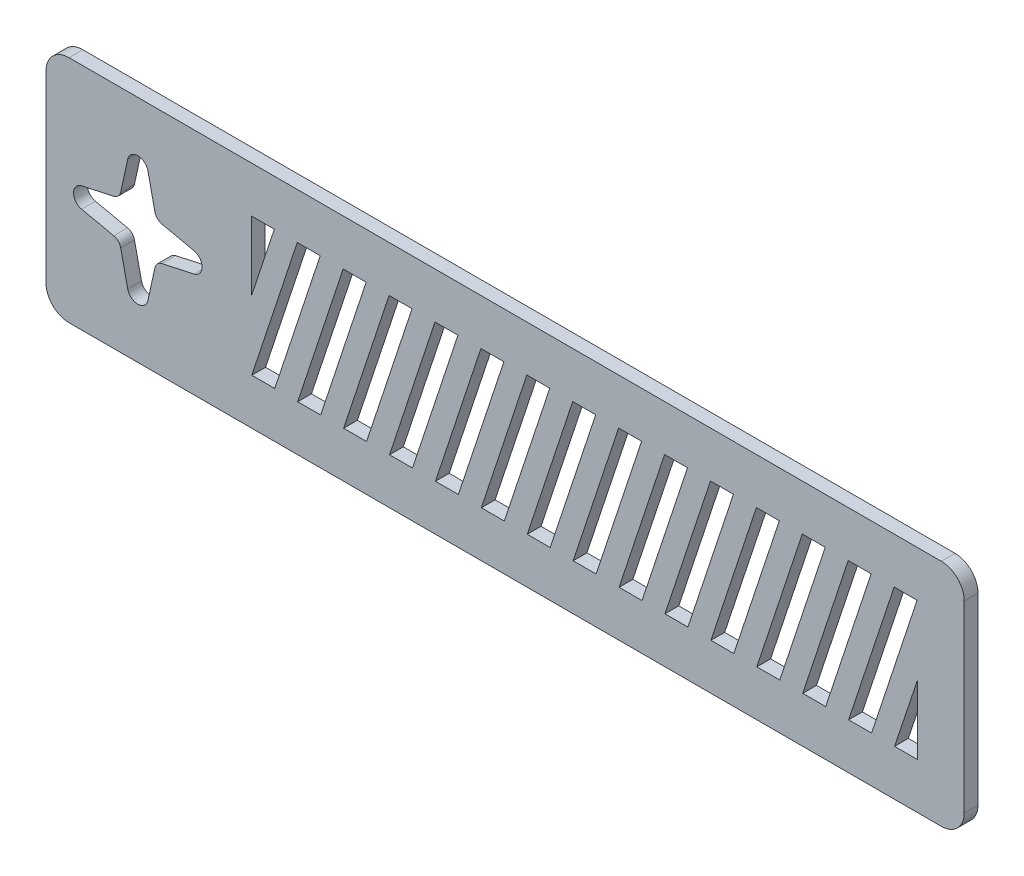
ISO-10303-21;
HEADER;
FILE_DESCRIPTION(('STEP AP214'),'2;1');
FILE_NAME('part.step','',(''),(''),'','','');
FILE_SCHEMA(('AUTOMOTIVE_DESIGN { 1 0 10303 214 1 1 1 1 }'));
ENDSEC;
DATA;
#1=APPLICATION_CONTEXT('core data for automotive mechanical design processes');
#2=APPLICATION_PROTOCOL_DEFINITION('international standard','automotive_design',2000,#1);
#3=PRODUCT_CONTEXT('',#1,'mechanical');
#4=PRODUCT('Part','Part','',(#3));
#5=PRODUCT_RELATED_PRODUCT_CATEGORY('part','',(#4));
#6=PRODUCT_DEFINITION_FORMATION('','',#4);
#7=PRODUCT_DEFINITION_CONTEXT('part definition',#1,'design');
#8=PRODUCT_DEFINITION('design','',#6,#7);
#9=PRODUCT_DEFINITION_SHAPE('','',#8);
#10=(LENGTH_UNIT() NAMED_UNIT(*) SI_UNIT(.MILLI.,.METRE.));
#11=(NAMED_UNIT(*) PLANE_ANGLE_UNIT() SI_UNIT($,.RADIAN.));
#12=(NAMED_UNIT(*) SI_UNIT($,.STERADIAN.) SOLID_ANGLE_UNIT());
#13=UNCERTAINTY_MEASURE_WITH_UNIT(LENGTH_MEASURE(1.E-05),#10,'distance_accuracy_value','');
#14=(GEOMETRIC_REPRESENTATION_CONTEXT(3) GLOBAL_UNCERTAINTY_ASSIGNED_CONTEXT((#13)) GLOBAL_UNIT_ASSIGNED_CONTEXT((#10,
#11,#12)) REPRESENTATION_CONTEXT('',''));
#15=CARTESIAN_POINT('',(0.,0.,0.));
#16=DIRECTION('',(0.,0.,1.));
#17=DIRECTION('',(1.,0.,0.));
#18=AXIS2_PLACEMENT_3D('',#15,#16,#17);
#19=CARTESIAN_POINT('',(-29.,-20.,3.));
#20=DIRECTION('',(0.,0.,1.));
#21=DIRECTION('',(1.,0.,0.));
#22=AXIS2_PLACEMENT_3D('',#19,#20,#21);
#23=PLANE('',#22);
#24=CARTESIAN_POINT('',(-29.,-20.,3.));
#25=DIRECTION('',(0.,0.,1.));
#26=DIRECTION('',(1.,0.,0.));
#27=AXIS2_PLACEMENT_3D('',#24,#25,#26);
#28=CIRCLE('',#27,5.);
#29=CARTESIAN_POINT('',(-34.,-20.,3.));
#30=VERTEX_POINT('',#29);
#31=CARTESIAN_POINT('',(-29.,-25.,3.));
#32=VERTEX_POINT('',#31);
#33=EDGE_CURVE('E1168',#30,#32,#28,.T.);
#34=ORIENTED_EDGE('',*,*,#33,.T.);
#35=DIRECTION('',(1.,0.,0.));
#36=VECTOR('',#35,1.);
#37=CARTESIAN_POINT('',(-29.,-25.,3.));
#38=LINE('',#37,#36);
#39=CARTESIAN_POINT('',(161.,-25.,3.));
#40=VERTEX_POINT('',#39);
#41=EDGE_CURVE('E1171',#32,#40,#38,.T.);
#42=ORIENTED_EDGE('',*,*,#41,.T.);
#43=CARTESIAN_POINT('',(161.,-20.,3.));
#44=DIRECTION('',(0.,0.,1.));
#45=DIRECTION('',(1.,0.,0.));
#46=AXIS2_PLACEMENT_3D('',#43,#44,#45);
#47=CIRCLE('',#46,5.);
#48=CARTESIAN_POINT('',(166.,-20.,3.));
#49=VERTEX_POINT('',#48);
#50=EDGE_CURVE('E1174',#40,#49,#47,.T.);
#51=ORIENTED_EDGE('',*,*,#50,.T.);
#52=DIRECTION('',(0.,1.,0.));
#53=VECTOR('',#52,1.);
#54=CARTESIAN_POINT('',(166.,20.,3.));
#55=LINE('',#54,#53);
#56=CARTESIAN_POINT('',(166.,20.,3.));
#57=VERTEX_POINT('',#56);
#58=EDGE_CURVE('E1176',#49,#57,#55,.T.);
#59=ORIENTED_EDGE('',*,*,#58,.T.);
#60=CARTESIAN_POINT('',(161.,20.,3.));
#61=DIRECTION('',(0.,0.,1.));
#62=DIRECTION('',(-1.,0.,0.));
#63=AXIS2_PLACEMENT_3D('',#60,#61,#62);
#64=CIRCLE('',#63,5.);
#65=CARTESIAN_POINT('',(161.,25.,3.));
#66=VERTEX_POINT('',#65);
#67=EDGE_CURVE('E1178',#57,#66,#64,.T.);
#68=ORIENTED_EDGE('',*,*,#67,.T.);
#69=DIRECTION('',(-1.,0.,0.));
#70=VECTOR('',#69,1.);
#71=CARTESIAN_POINT('',(-29.,25.,3.));
#72=LINE('',#71,#70);
#73=CARTESIAN_POINT('',(-29.,25.,3.));
#74=VERTEX_POINT('',#73);
#75=EDGE_CURVE('E1180',#66,#74,#72,.T.);
#76=ORIENTED_EDGE('',*,*,#75,.T.);
#77=CARTESIAN_POINT('',(-29.,20.,3.));
#78=DIRECTION('',(0.,0.,1.));
#79=DIRECTION('',(1.,0.,0.));
#80=AXIS2_PLACEMENT_3D('',#77,#78,#79);
#81=CIRCLE('',#80,5.);
#82=CARTESIAN_POINT('',(-34.,20.,3.));
#83=VERTEX_POINT('',#82);
#84=EDGE_CURVE('E1182',#74,#83,#81,.T.);
#85=ORIENTED_EDGE('',*,*,#84,.T.);
#86=DIRECTION('',(0.,-1.,0.));
#87=VECTOR('',#86,1.);
#88=CARTESIAN_POINT('',(-34.,20.,3.));
#89=LINE('',#88,#87);
#90=EDGE_CURVE('E1184',#83,#30,#89,.T.);
#91=ORIENTED_EDGE('',*,*,#90,.T.);
#92=EDGE_LOOP('',(#34,#42,#51,#59,#68,#76,#85,#91));
#93=FACE_BOUND('',#92,.T.);
#94=DIRECTION('',(-0.213864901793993,-0.976863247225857,0.));
#95=VECTOR('',#94,1.);
#96=CARTESIAN_POINT('',(-16.1979423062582,12.2311960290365,3.));
#97=LINE('',#96,#95);
#98=CARTESIAN_POINT('',(-16.1979423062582,12.2311960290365,3.));
#99=VERTEX_POINT('',#98);
#100=CARTESIAN_POINT('',(-17.7259180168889,5.25191470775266,3.));
#101=VERTEX_POINT('',#100);
#102=EDGE_CURVE('E1055',#99,#101,#97,.T.);
#103=ORIENTED_EDGE('',*,*,#102,.F.);
#104=CARTESIAN_POINT('',(-14.,11.75,3.));
#105=DIRECTION('',(0.,0.,1.));
#106=DIRECTION('',(1.,0.,0.));
#107=AXIS2_PLACEMENT_3D('',#104,#105,#106);
#108=CIRCLE('',#107,2.25);
#109=CARTESIAN_POINT('',(-11.8020576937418,12.2311960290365,3.));
#110=VERTEX_POINT('',#109);
#111=EDGE_CURVE('E1053',#110,#99,#108,.T.);
#112=ORIENTED_EDGE('',*,*,#111,.F.);
#113=DIRECTION('',(-0.21386490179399,0.976863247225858,0.));
#114=VECTOR('',#113,1.);
#115=CARTESIAN_POINT('',(-10.2740819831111,5.25191470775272,3.));
#116=LINE('',#115,#114);
#117=CARTESIAN_POINT('',(-10.2740819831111,5.25191470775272,3.));
#118=VERTEX_POINT('',#117);
#119=EDGE_CURVE('E1085',#118,#110,#116,.T.);
#120=ORIENTED_EDGE('',*,*,#119,.F.);
#121=CARTESIAN_POINT('',(-8.32035548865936,5.67964451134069,3.));
#122=DIRECTION('',(0.,0.,-1.));
#123=DIRECTION('',(-1.,0.,0.));
#124=AXIS2_PLACEMENT_3D('',#121,#122,#123);
#125=CIRCLE('',#124,2.);
#126=CARTESIAN_POINT('',(-8.74808529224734,3.72591801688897,3.));
#127=VERTEX_POINT('',#126);
#128=EDGE_CURVE('E1082',#127,#118,#125,.T.);
#129=ORIENTED_EDGE('',*,*,#128,.F.);
#130=DIRECTION('',(-0.976863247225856,0.213864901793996,0.));
#131=VECTOR('',#130,1.);
#132=CARTESIAN_POINT('',(-8.74808529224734,3.72591801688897,3.));
#133=LINE('',#132,#131);
#134=CARTESIAN_POINT('',(-1.76880397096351,2.19794230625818,3.));
#135=VERTEX_POINT('',#134);
#136=EDGE_CURVE('E1080',#135,#127,#133,.T.);
#137=ORIENTED_EDGE('',*,*,#136,.F.);
#138=CARTESIAN_POINT('',(-2.25,0.,3.));
#139=DIRECTION('',(0.,0.,1.));
#140=DIRECTION('',(1.,0.,0.));
#141=AXIS2_PLACEMENT_3D('',#138,#139,#140);
#142=CIRCLE('',#141,2.25);
#143=CARTESIAN_POINT('',(-1.76880397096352,-2.19794230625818,3.));
#144=VERTEX_POINT('',#143);
#145=EDGE_CURVE('E1078',#144,#135,#142,.T.);
#146=ORIENTED_EDGE('',*,*,#145,.F.);
#147=DIRECTION('',(0.976863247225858,0.213864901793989,0.));
#148=VECTOR('',#147,1.);
#149=CARTESIAN_POINT('',(-1.76880397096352,-2.19794230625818,3.));
#150=LINE('',#149,#148);
#151=CARTESIAN_POINT('',(-8.74808529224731,-3.72591801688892,3.));
#152=VERTEX_POINT('',#151);
#153=EDGE_CURVE('E1076',#152,#144,#150,.T.);
#154=ORIENTED_EDGE('',*,*,#153,.F.);
#155=CARTESIAN_POINT('',(-8.32035548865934,-5.67964451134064,3.));
#156=DIRECTION('',(0.,0.,-1.));
#157=DIRECTION('',(-1.,0.,0.));
#158=AXIS2_PLACEMENT_3D('',#155,#156,#157);
#159=CIRCLE('',#158,2.);
#160=CARTESIAN_POINT('',(-10.2740819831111,-5.25191470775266,3.));
#161=VERTEX_POINT('',#160);
#162=EDGE_CURVE('E1074',#161,#152,#159,.T.);
#163=ORIENTED_EDGE('',*,*,#162,.F.);
#164=DIRECTION('',(0.213864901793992,0.976863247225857,0.));
#165=VECTOR('',#164,1.);
#166=CARTESIAN_POINT('',(-10.2740819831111,-5.25191470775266,3.));
#167=LINE('',#166,#165);
#168=CARTESIAN_POINT('',(-11.8020576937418,-12.2311960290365,3.));
#169=VERTEX_POINT('',#168);
#170=EDGE_CURVE('E1072',#169,#161,#167,.T.);
#171=ORIENTED_EDGE('',*,*,#170,.F.);
#172=CARTESIAN_POINT('',(-14.,-11.75,3.));
#173=DIRECTION('',(0.,0.,1.));
#174=DIRECTION('',(1.,0.,0.));
#175=AXIS2_PLACEMENT_3D('',#172,#173,#174);
#176=CIRCLE('',#175,2.25);
#177=CARTESIAN_POINT('',(-16.1979423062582,-12.2311960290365,3.));
#178=VERTEX_POINT('',#177);
#179=EDGE_CURVE('E1070',#178,#169,#176,.T.);
#180=ORIENTED_EDGE('',*,*,#179,.F.);
#181=DIRECTION('',(0.21386490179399,-0.976863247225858,0.));
#182=VECTOR('',#181,1.);
#183=CARTESIAN_POINT('',(-17.7259180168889,-5.25191470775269,3.));
#184=LINE('',#183,#182);
#185=CARTESIAN_POINT('',(-17.7259180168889,-5.25191470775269,3.));
#186=VERTEX_POINT('',#185);
#187=EDGE_CURVE('E1068',#186,#178,#184,.T.);
#188=ORIENTED_EDGE('',*,*,#187,.F.);
#189=CARTESIAN_POINT('',(-19.6796445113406,-5.67964451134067,3.));
#190=DIRECTION('',(0.,0.,-1.));
#191=DIRECTION('',(1.,0.,0.));
#192=AXIS2_PLACEMENT_3D('',#189,#190,#191);
#193=CIRCLE('',#192,2.);
#194=CARTESIAN_POINT('',(-19.2519147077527,-3.72591801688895,3.));
#195=VERTEX_POINT('',#194);
#196=EDGE_CURVE('E1066',#195,#186,#193,.T.);
#197=ORIENTED_EDGE('',*,*,#196,.F.);
#198=DIRECTION('',(0.976863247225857,-0.213864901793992,0.));
#199=VECTOR('',#198,1.);
#200=CARTESIAN_POINT('',(-26.2311960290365,-2.19794230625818,3.));
#201=LINE('',#200,#199);
#202=CARTESIAN_POINT('',(-26.2311960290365,-2.19794230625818,3.));
#203=VERTEX_POINT('',#202);
#204=EDGE_CURVE('E1064',#203,#195,#201,.T.);
#205=ORIENTED_EDGE('',*,*,#204,.F.);
#206=CARTESIAN_POINT('',(-25.75,0.,3.));
#207=DIRECTION('',(0.,0.,1.));
#208=DIRECTION('',(1.,0.,0.));
#209=AXIS2_PLACEMENT_3D('',#206,#207,#208);
#210=CIRCLE('',#209,2.25);
#211=CARTESIAN_POINT('',(-26.2311960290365,2.19794230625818,3.));
#212=VERTEX_POINT('',#211);
#213=EDGE_CURVE('E1062',#212,#203,#210,.T.);
#214=ORIENTED_EDGE('',*,*,#213,.F.);
#215=DIRECTION('',(-0.976863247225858,-0.21386490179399,0.));
#216=VECTOR('',#215,1.);
#217=CARTESIAN_POINT('',(-19.2519147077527,3.72591801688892,3.));
#218=LINE('',#217,#216);
#219=CARTESIAN_POINT('',(-19.2519147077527,3.72591801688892,3.));
#220=VERTEX_POINT('',#219);
#221=EDGE_CURVE('E1060',#220,#212,#218,.T.);
#222=ORIENTED_EDGE('',*,*,#221,.F.);
#223=CARTESIAN_POINT('',(-19.6796445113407,5.67964451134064,3.));
#224=DIRECTION('',(0.,0.,-1.));
#225=DIRECTION('',(1.,0.,0.));
#226=AXIS2_PLACEMENT_3D('',#223,#224,#225);
#227=CIRCLE('',#226,2.);
#228=EDGE_CURVE('E1058',#101,#220,#227,.T.);
#229=ORIENTED_EDGE('',*,*,#228,.F.);
#230=EDGE_LOOP('',(#103,#112,#120,#129,#137,#146,#154,#163,#171,#180,#188,#197,#205,#214,#222,#229));
#231=FACE_BOUND('',#230,.T.);
#232=DIRECTION('',(1.,0.,0.));
#233=VECTOR('',#232,1.);
#234=CARTESIAN_POINT('',(90.8230798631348,-15.,3.));
#235=LINE('',#234,#233);
#236=CARTESIAN_POINT('',(90.8230798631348,-15.,3.));
#237=VERTEX_POINT('',#236);
#238=CARTESIAN_POINT('',(95.8230798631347,-15.,3.));
#239=VERTEX_POINT('',#238);
#240=EDGE_CURVE('E1024',#237,#239,#235,.T.);
#241=ORIENTED_EDGE('',*,*,#240,.F.);
#242=DIRECTION('',(-0.313526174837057,-0.949579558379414,0.));
#243=VECTOR('',#242,1.);
#244=CARTESIAN_POINT('',(100.728290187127,15.,3.));
#245=LINE('',#244,#243);
#246=CARTESIAN_POINT('',(100.728290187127,15.,3.));
#247=VERTEX_POINT('',#246);
#248=EDGE_CURVE('E1022',#247,#237,#245,.T.);
#249=ORIENTED_EDGE('',*,*,#248,.F.);
#250=DIRECTION('',(-1.,0.,0.));
#251=VECTOR('',#250,1.);
#252=CARTESIAN_POINT('',(100.728290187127,15.,3.));
#253=LINE('',#252,#251);
#254=CARTESIAN_POINT('',(105.728290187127,15.,3.));
#255=VERTEX_POINT('',#254);
#256=EDGE_CURVE('E1030',#255,#247,#253,.T.);
#257=ORIENTED_EDGE('',*,*,#256,.F.);
#258=DIRECTION('',(0.313526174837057,0.949579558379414,0.));
#259=VECTOR('',#258,1.);
#260=CARTESIAN_POINT('',(105.728290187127,15.,3.));
#261=LINE('',#260,#259);
#262=EDGE_CURVE('E1027',#239,#255,#261,.T.);
#263=ORIENTED_EDGE('',*,*,#262,.F.);
#264=EDGE_LOOP('',(#241,#249,#257,#263));
#265=FACE_BOUND('',#264,.T.);
#266=DIRECTION('',(-0.313526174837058,-0.949579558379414,0.));
#267=VECTOR('',#266,1.);
#268=CARTESIAN_POINT('',(20.7282901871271,15.,3.));
#269=LINE('',#268,#267);
#270=CARTESIAN_POINT('',(20.7282901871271,15.,3.));
#271=VERTEX_POINT('',#270);
#272=CARTESIAN_POINT('',(10.8230798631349,-15.,3.));
#273=VERTEX_POINT('',#272);
#274=EDGE_CURVE('E993',#271,#273,#269,.T.);
#275=ORIENTED_EDGE('',*,*,#274,.F.);
#276=DIRECTION('',(-1.,0.,0.));
#277=VECTOR('',#276,1.);
#278=CARTESIAN_POINT('',(20.7282901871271,15.,3.));
#279=LINE('',#278,#277);
#280=CARTESIAN_POINT('',(25.728290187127,15.,3.));
#281=VERTEX_POINT('',#280);
#282=EDGE_CURVE('E991',#281,#271,#279,.T.);
#283=ORIENTED_EDGE('',*,*,#282,.F.);
#284=DIRECTION('',(0.313526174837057,0.949579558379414,0.));
#285=VECTOR('',#284,1.);
#286=CARTESIAN_POINT('',(25.728290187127,15.,3.));
#287=LINE('',#286,#285);
#288=CARTESIAN_POINT('',(15.8230798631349,-15.,3.));
#289=VERTEX_POINT('',#288);
#290=EDGE_CURVE('E999',#289,#281,#287,.T.);
#291=ORIENTED_EDGE('',*,*,#290,.F.);
#292=DIRECTION('',(1.,0.,0.));
#293=VECTOR('',#292,1.);
#294=CARTESIAN_POINT('',(10.8230798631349,-15.,3.));
#295=LINE('',#294,#293);
#296=EDGE_CURVE('E996',#273,#289,#295,.T.);
#297=ORIENTED_EDGE('',*,*,#296,.F.);
#298=EDGE_LOOP('',(#275,#283,#291,#297));
#299=FACE_BOUND('',#298,.T.);
#300=DIRECTION('',(0.313526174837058,0.949579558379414,0.));
#301=VECTOR('',#300,1.);
#302=CARTESIAN_POINT('',(15.7282901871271,15.,3.));
#303=LINE('',#302,#301);
#304=CARTESIAN_POINT('',(10.7282901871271,-0.143545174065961,3.));
#305=VERTEX_POINT('',#304);
#306=CARTESIAN_POINT('',(15.7282901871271,15.,3.));
#307=VERTEX_POINT('',#306);
#308=EDGE_CURVE('E969',#305,#307,#303,.T.);
#309=ORIENTED_EDGE('',*,*,#308,.F.);
#310=DIRECTION('',(0.,-1.,0.));
#311=VECTOR('',#310,1.);
#312=CARTESIAN_POINT('',(10.7282901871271,15.,3.));
#313=LINE('',#312,#311);
#314=CARTESIAN_POINT('',(10.7282901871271,15.,3.));
#315=VERTEX_POINT('',#314);
#316=EDGE_CURVE('E967',#315,#305,#313,.T.);
#317=ORIENTED_EDGE('',*,*,#316,.F.);
#318=DIRECTION('',(-1.,0.,0.));
#319=VECTOR('',#318,1.);
#320=CARTESIAN_POINT('',(15.7282901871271,15.,3.));
#321=LINE('',#320,#319);
#322=EDGE_CURVE('E973',#307,#315,#321,.T.);
#323=ORIENTED_EDGE('',*,*,#322,.F.);
#324=EDGE_LOOP('',(#309,#317,#323));
#325=FACE_BOUND('',#324,.T.);
#326=DIRECTION('',(1.,0.,0.));
#327=VECTOR('',#326,1.);
#328=CARTESIAN_POINT('',(150.823079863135,-15.,3.));
#329=LINE('',#328,#327);
#330=CARTESIAN_POINT('',(150.823079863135,-15.,3.));
#331=VERTEX_POINT('',#330);
#332=CARTESIAN_POINT('',(155.823079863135,-15.,3.));
#333=VERTEX_POINT('',#332);
#334=EDGE_CURVE('E945',#331,#333,#329,.T.);
#335=ORIENTED_EDGE('',*,*,#334,.F.);
#336=DIRECTION('',(-0.316227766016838,-0.948683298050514,0.));
#337=VECTOR('',#336,1.);
#338=CARTESIAN_POINT('',(155.823079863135,0.,3.));
#339=LINE('',#338,#337);
#340=CARTESIAN_POINT('',(155.823079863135,0.,3.));
#341=VERTEX_POINT('',#340);
#342=EDGE_CURVE('E943',#341,#331,#339,.T.);
#343=ORIENTED_EDGE('',*,*,#342,.F.);
#344=DIRECTION('',(0.,1.,0.));
#345=VECTOR('',#344,1.);
#346=CARTESIAN_POINT('',(155.823079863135,-15.,3.));
#347=LINE('',#346,#345);
#348=EDGE_CURVE('E949',#333,#341,#347,.T.);
#349=ORIENTED_EDGE('',*,*,#348,.F.);
#350=EDGE_LOOP('',(#335,#343,#349));
#351=FACE_BOUND('',#350,.T.);
#352=DIRECTION('',(-1.,0.,0.));
#353=VECTOR('',#352,1.);
#354=CARTESIAN_POINT('',(90.7282901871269,15.,3.));
#355=LINE('',#354,#353);
#356=CARTESIAN_POINT('',(95.728290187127,15.,3.));
#357=VERTEX_POINT('',#356);
#358=CARTESIAN_POINT('',(90.7282901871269,15.,3.));
#359=VERTEX_POINT('',#358);
#360=EDGE_CURVE('E914',#357,#359,#355,.T.);
#361=ORIENTED_EDGE('',*,*,#360,.F.);
#362=DIRECTION('',(0.313526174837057,0.949579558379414,0.));
#363=VECTOR('',#362,1.);
#364=CARTESIAN_POINT('',(95.728290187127,15.,3.));
#365=LINE('',#364,#363);
#366=CARTESIAN_POINT('',(85.8230798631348,-15.,3.));
#367=VERTEX_POINT('',#366);
#368=EDGE_CURVE('E912',#367,#357,#365,.T.);
#369=ORIENTED_EDGE('',*,*,#368,.F.);
#370=DIRECTION('',(1.,0.,0.));
#371=VECTOR('',#370,1.);
#372=CARTESIAN_POINT('',(80.8230798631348,-15.,3.));
#373=LINE('',#372,#371);
#374=CARTESIAN_POINT('',(80.8230798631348,-15.,3.));
#375=VERTEX_POINT('',#374);
#376=EDGE_CURVE('E920',#375,#367,#373,.T.);
#377=ORIENTED_EDGE('',*,*,#376,.F.);
#378=DIRECTION('',(-0.313526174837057,-0.949579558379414,0.));
#379=VECTOR('',#378,1.);
#380=CARTESIAN_POINT('',(90.7282901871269,15.,3.));
#381=LINE('',#380,#379);
#382=EDGE_CURVE('E917',#359,#375,#381,.T.);
#383=ORIENTED_EDGE('',*,*,#382,.F.);
#384=EDGE_LOOP('',(#361,#369,#377,#383));
#385=FACE_BOUND('',#384,.T.);
#386=DIRECTION('',(-1.,0.,0.));
#387=VECTOR('',#386,1.);
#388=CARTESIAN_POINT('',(80.728290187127,15.,3.));
#389=LINE('',#388,#387);
#390=CARTESIAN_POINT('',(85.728290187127,15.,3.));
#391=VERTEX_POINT('',#390);
#392=CARTESIAN_POINT('',(80.728290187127,15.,3.));
#393=VERTEX_POINT('',#392);
#394=EDGE_CURVE('E883',#391,#393,#389,.T.);
#395=ORIENTED_EDGE('',*,*,#394,.F.);
#396=DIRECTION('',(0.313526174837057,0.949579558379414,0.));
#397=VECTOR('',#396,1.);
#398=CARTESIAN_POINT('',(85.728290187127,15.,3.));
#399=LINE('',#398,#397);
#400=CARTESIAN_POINT('',(75.8230798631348,-15.,3.));
#401=VERTEX_POINT('',#400);
#402=EDGE_CURVE('E881',#401,#391,#399,.T.);
#403=ORIENTED_EDGE('',*,*,#402,.F.);
#404=DIRECTION('',(1.,0.,0.));
#405=VECTOR('',#404,1.);
#406=CARTESIAN_POINT('',(70.8230798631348,-15.,3.));
#407=LINE('',#406,#405);
#408=CARTESIAN_POINT('',(70.8230798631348,-15.,3.));
#409=VERTEX_POINT('',#408);
#410=EDGE_CURVE('E889',#409,#401,#407,.T.);
#411=ORIENTED_EDGE('',*,*,#410,.F.);
#412=DIRECTION('',(-0.313526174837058,-0.949579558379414,0.));
#413=VECTOR('',#412,1.);
#414=CARTESIAN_POINT('',(80.728290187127,15.,3.));
#415=LINE('',#414,#413);
#416=EDGE_CURVE('E886',#393,#409,#415,.T.);
#417=ORIENTED_EDGE('',*,*,#416,.F.);
#418=EDGE_LOOP('',(#395,#403,#411,#417));
#419=FACE_BOUND('',#418,.T.);
#420=DIRECTION('',(1.,0.,0.));
#421=VECTOR('',#420,1.);
#422=CARTESIAN_POINT('',(100.823079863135,-15.,3.));
#423=LINE('',#422,#421);
#424=CARTESIAN_POINT('',(100.823079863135,-15.,3.));
#425=VERTEX_POINT('',#424);
#426=CARTESIAN_POINT('',(105.823079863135,-15.,3.));
#427=VERTEX_POINT('',#426);
#428=EDGE_CURVE('E852',#425,#427,#423,.T.);
#429=ORIENTED_EDGE('',*,*,#428,.F.);
#430=DIRECTION('',(-0.313526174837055,-0.949579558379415,0.));
#431=VECTOR('',#430,1.);
#432=CARTESIAN_POINT('',(110.728290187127,15.,3.));
#433=LINE('',#432,#431);
#434=CARTESIAN_POINT('',(110.728290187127,15.,3.));
#435=VERTEX_POINT('',#434);
#436=EDGE_CURVE('E850',#435,#425,#433,.T.);
#437=ORIENTED_EDGE('',*,*,#436,.F.);
#438=DIRECTION('',(-1.,0.,0.));
#439=VECTOR('',#438,1.);
#440=CARTESIAN_POINT('',(110.728290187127,15.,3.));
#441=LINE('',#440,#439);
#442=CARTESIAN_POINT('',(115.728290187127,15.,3.));
#443=VERTEX_POINT('',#442);
#444=EDGE_CURVE('E858',#443,#435,#441,.T.);
#445=ORIENTED_EDGE('',*,*,#444,.F.);
#446=DIRECTION('',(0.313526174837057,0.949579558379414,0.));
#447=VECTOR('',#446,1.);
#448=CARTESIAN_POINT('',(115.728290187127,15.,3.));
#449=LINE('',#448,#447);
#450=EDGE_CURVE('E855',#427,#443,#449,.T.);
#451=ORIENTED_EDGE('',*,*,#450,.F.);
#452=EDGE_LOOP('',(#429,#437,#445,#451));
#453=FACE_BOUND('',#452,.T.);
#454=DIRECTION('',(1.,0.,0.));
#455=VECTOR('',#454,1.);
#456=CARTESIAN_POINT('',(60.8230798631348,-15.,3.));
#457=LINE('',#456,#455);
#458=CARTESIAN_POINT('',(60.8230798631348,-15.,3.));
#459=VERTEX_POINT('',#458);
#460=CARTESIAN_POINT('',(65.8230798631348,-15.,3.));
#461=VERTEX_POINT('',#460);
#462=EDGE_CURVE('E821',#459,#461,#457,.T.);
#463=ORIENTED_EDGE('',*,*,#462,.F.);
#464=DIRECTION('',(-0.313526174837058,-0.949579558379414,0.));
#465=VECTOR('',#464,1.);
#466=CARTESIAN_POINT('',(70.728290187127,15.,3.));
#467=LINE('',#466,#465);
#468=CARTESIAN_POINT('',(70.728290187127,15.,3.));
#469=VERTEX_POINT('',#468);
#470=EDGE_CURVE('E819',#469,#459,#467,.T.);
#471=ORIENTED_EDGE('',*,*,#470,.F.);
#472=DIRECTION('',(-1.,0.,0.));
#473=VECTOR('',#472,1.);
#474=CARTESIAN_POINT('',(70.728290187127,15.,3.));
#475=LINE('',#474,#473);
#476=CARTESIAN_POINT('',(75.728290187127,15.,3.));
#477=VERTEX_POINT('',#476);
#478=EDGE_CURVE('E827',#477,#469,#475,.T.);
#479=ORIENTED_EDGE('',*,*,#478,.F.);
#480=DIRECTION('',(0.313526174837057,0.949579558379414,0.));
#481=VECTOR('',#480,1.);
#482=CARTESIAN_POINT('',(75.728290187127,15.,3.));
#483=LINE('',#482,#481);
#484=EDGE_CURVE('E824',#461,#477,#483,.T.);
#485=ORIENTED_EDGE('',*,*,#484,.F.);
#486=EDGE_LOOP('',(#463,#471,#479,#485));
#487=FACE_BOUND('',#486,.T.);
#488=DIRECTION('',(-1.,0.,0.));
#489=VECTOR('',#488,1.);
#490=CARTESIAN_POINT('',(60.728290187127,15.,3.));
#491=LINE('',#490,#489);
#492=CARTESIAN_POINT('',(65.728290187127,15.,3.));
#493=VERTEX_POINT('',#492);
#494=CARTESIAN_POINT('',(60.728290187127,15.,3.));
#495=VERTEX_POINT('',#494);
#496=EDGE_CURVE('E790',#493,#495,#491,.T.);
#497=ORIENTED_EDGE('',*,*,#496,.F.);
#498=DIRECTION('',(0.313526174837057,0.949579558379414,0.));
#499=VECTOR('',#498,1.);
#500=CARTESIAN_POINT('',(65.728290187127,15.,3.));
#501=LINE('',#500,#499);
#502=CARTESIAN_POINT('',(55.8230798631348,-15.,3.));
#503=VERTEX_POINT('',#502);
#504=EDGE_CURVE('E788',#503,#493,#501,.T.);
#505=ORIENTED_EDGE('',*,*,#504,.F.);
#506=DIRECTION('',(1.,0.,0.));
#507=VECTOR('',#506,1.);
#508=CARTESIAN_POINT('',(50.8230798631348,-15.,3.));
#509=LINE('',#508,#507);
#510=CARTESIAN_POINT('',(50.8230798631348,-15.,3.));
#511=VERTEX_POINT('',#510);
#512=EDGE_CURVE('E796',#511,#503,#509,.T.);
#513=ORIENTED_EDGE('',*,*,#512,.F.);
#514=DIRECTION('',(-0.313526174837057,-0.949579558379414,0.));
#515=VECTOR('',#514,1.);
#516=CARTESIAN_POINT('',(60.728290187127,15.,3.));
#517=LINE('',#516,#515);
#518=EDGE_CURVE('E793',#495,#511,#517,.T.);
#519=ORIENTED_EDGE('',*,*,#518,.F.);
#520=EDGE_LOOP('',(#497,#505,#513,#519));
#521=FACE_BOUND('',#520,.T.);
#522=DIRECTION('',(1.,0.,0.));
#523=VECTOR('',#522,1.);
#524=CARTESIAN_POINT('',(110.823079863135,-15.,3.));
#525=LINE('',#524,#523);
#526=CARTESIAN_POINT('',(110.823079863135,-15.,3.));
#527=VERTEX_POINT('',#526);
#528=CARTESIAN_POINT('',(115.823079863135,-15.,3.));
#529=VERTEX_POINT('',#528);
#530=EDGE_CURVE('E759',#527,#529,#525,.T.);
#531=ORIENTED_EDGE('',*,*,#530,.F.);
#532=DIRECTION('',(-0.313526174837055,-0.949579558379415,0.));
#533=VECTOR('',#532,1.);
#534=CARTESIAN_POINT('',(120.728290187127,15.,3.));
#535=LINE('',#534,#533);
#536=CARTESIAN_POINT('',(120.728290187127,15.,3.));
#537=VERTEX_POINT('',#536);
#538=EDGE_CURVE('E757',#537,#527,#535,.T.);
#539=ORIENTED_EDGE('',*,*,#538,.F.);
#540=DIRECTION('',(-1.,0.,0.));
#541=VECTOR('',#540,1.);
#542=CARTESIAN_POINT('',(120.728290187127,15.,3.));
#543=LINE('',#542,#541);
#544=CARTESIAN_POINT('',(125.728290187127,15.,3.));
#545=VERTEX_POINT('',#544);
#546=EDGE_CURVE('E765',#545,#537,#543,.T.);
#547=ORIENTED_EDGE('',*,*,#546,.F.);
#548=DIRECTION('',(0.313526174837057,0.949579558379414,0.));
#549=VECTOR('',#548,1.);
#550=CARTESIAN_POINT('',(125.728290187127,15.,3.));
#551=LINE('',#550,#549);
#552=EDGE_CURVE('E762',#529,#545,#551,.T.);
#553=ORIENTED_EDGE('',*,*,#552,.F.);
#554=EDGE_LOOP('',(#531,#539,#547,#553));
#555=FACE_BOUND('',#554,.T.);
#556=DIRECTION('',(1.,0.,0.));
#557=VECTOR('',#556,1.);
#558=CARTESIAN_POINT('',(120.823079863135,-15.,3.));
#559=LINE('',#558,#557);
#560=CARTESIAN_POINT('',(120.823079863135,-15.,3.));
#561=VERTEX_POINT('',#560);
#562=CARTESIAN_POINT('',(125.823079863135,-15.,3.));
#563=VERTEX_POINT('',#562);
#564=EDGE_CURVE('E728',#561,#563,#559,.T.);
#565=ORIENTED_EDGE('',*,*,#564,.F.);
#566=DIRECTION('',(-0.313526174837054,-0.949579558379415,0.));
#567=VECTOR('',#566,1.);
#568=CARTESIAN_POINT('',(130.728290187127,15.,3.));
#569=LINE('',#568,#567);
#570=CARTESIAN_POINT('',(130.728290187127,15.,3.));
#571=VERTEX_POINT('',#570);
#572=EDGE_CURVE('E726',#571,#561,#569,.T.);
#573=ORIENTED_EDGE('',*,*,#572,.F.);
#574=DIRECTION('',(-1.,0.,0.));
#575=VECTOR('',#574,1.);
#576=CARTESIAN_POINT('',(130.728290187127,15.,3.));
#577=LINE('',#576,#575);
#578=CARTESIAN_POINT('',(135.728290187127,15.,3.));
#579=VERTEX_POINT('',#578);
#580=EDGE_CURVE('E734',#579,#571,#577,.T.);
#581=ORIENTED_EDGE('',*,*,#580,.F.);
#582=DIRECTION('',(0.313526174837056,0.949579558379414,0.));
#583=VECTOR('',#582,1.);
#584=CARTESIAN_POINT('',(135.728290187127,15.,3.));
#585=LINE('',#584,#583);
#586=EDGE_CURVE('E731',#563,#579,#585,.T.);
#587=ORIENTED_EDGE('',*,*,#586,.F.);
#588=EDGE_LOOP('',(#565,#573,#581,#587));
#589=FACE_BOUND('',#588,.T.);
#590=DIRECTION('',(-1.,0.,0.));
#591=VECTOR('',#590,1.);
#592=CARTESIAN_POINT('',(50.728290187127,15.,3.));
#593=LINE('',#592,#591);
#594=CARTESIAN_POINT('',(55.728290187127,15.,3.));
#595=VERTEX_POINT('',#594);
#596=CARTESIAN_POINT('',(50.728290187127,15.,3.));
#597=VERTEX_POINT('',#596);
#598=EDGE_CURVE('E697',#595,#597,#593,.T.);
#599=ORIENTED_EDGE('',*,*,#598,.F.);
#600=DIRECTION('',(0.313526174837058,0.949579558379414,0.));
#601=VECTOR('',#600,1.);
#602=CARTESIAN_POINT('',(55.728290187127,15.,3.));
#603=LINE('',#602,#601);
#604=CARTESIAN_POINT('',(45.8230798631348,-15.,3.));
#605=VERTEX_POINT('',#604);
#606=EDGE_CURVE('E695',#605,#595,#603,.T.);
#607=ORIENTED_EDGE('',*,*,#606,.F.);
#608=DIRECTION('',(1.,0.,0.));
#609=VECTOR('',#608,1.);
#610=CARTESIAN_POINT('',(40.8230798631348,-15.,3.));
#611=LINE('',#610,#609);
#612=CARTESIAN_POINT('',(40.8230798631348,-15.,3.));
#613=VERTEX_POINT('',#612);
#614=EDGE_CURVE('E703',#613,#605,#611,.T.);
#615=ORIENTED_EDGE('',*,*,#614,.F.);
#616=DIRECTION('',(-0.313526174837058,-0.949579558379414,0.));
#617=VECTOR('',#616,1.);
#618=CARTESIAN_POINT('',(50.728290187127,15.,3.));
#619=LINE('',#618,#617);
#620=EDGE_CURVE('E700',#597,#613,#619,.T.);
#621=ORIENTED_EDGE('',*,*,#620,.F.);
#622=EDGE_LOOP('',(#599,#607,#615,#621));
#623=FACE_BOUND('',#622,.T.);
#624=DIRECTION('',(1.,0.,0.));
#625=VECTOR('',#624,1.);
#626=CARTESIAN_POINT('',(130.823079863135,-15.,3.));
#627=LINE('',#626,#625);
#628=CARTESIAN_POINT('',(130.823079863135,-15.,3.));
#629=VERTEX_POINT('',#628);
#630=CARTESIAN_POINT('',(135.823079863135,-15.,3.));
#631=VERTEX_POINT('',#630);
#632=EDGE_CURVE('E666',#629,#631,#627,.T.);
#633=ORIENTED_EDGE('',*,*,#632,.F.);
#634=DIRECTION('',(-0.313526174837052,-0.949579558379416,0.));
#635=VECTOR('',#634,1.);
#636=CARTESIAN_POINT('',(140.728290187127,15.,3.));
#637=LINE('',#636,#635);
#638=CARTESIAN_POINT('',(140.728290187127,15.,3.));
#639=VERTEX_POINT('',#638);
#640=EDGE_CURVE('E664',#639,#629,#637,.T.);
#641=ORIENTED_EDGE('',*,*,#640,.F.);
#642=DIRECTION('',(-1.,0.,0.));
#643=VECTOR('',#642,1.);
#644=CARTESIAN_POINT('',(140.728290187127,15.,3.));
#645=LINE('',#644,#643);
#646=CARTESIAN_POINT('',(145.728290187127,15.,3.));
#647=VERTEX_POINT('',#646);
#648=EDGE_CURVE('E672',#647,#639,#645,.T.);
#649=ORIENTED_EDGE('',*,*,#648,.F.);
#650=DIRECTION('',(0.313526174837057,0.949579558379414,0.));
#651=VECTOR('',#650,1.);
#652=CARTESIAN_POINT('',(145.728290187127,15.,3.));
#653=LINE('',#652,#651);
#654=EDGE_CURVE('E669',#631,#647,#653,.T.);
#655=ORIENTED_EDGE('',*,*,#654,.F.);
#656=EDGE_LOOP('',(#633,#641,#649,#655));
#657=FACE_BOUND('',#656,.T.);
#658=DIRECTION('',(-1.,0.,0.));
#659=VECTOR('',#658,1.);
#660=CARTESIAN_POINT('',(40.728290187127,15.,3.));
#661=LINE('',#660,#659);
#662=CARTESIAN_POINT('',(45.728290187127,15.,3.));
#663=VERTEX_POINT('',#662);
#664=CARTESIAN_POINT('',(40.728290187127,15.,3.));
#665=VERTEX_POINT('',#664);
#666=EDGE_CURVE('E635',#663,#665,#661,.T.);
#667=ORIENTED_EDGE('',*,*,#666,.F.);
#668=DIRECTION('',(0.313526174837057,0.949579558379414,0.));
#669=VECTOR('',#668,1.);
#670=CARTESIAN_POINT('',(45.728290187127,15.,3.));
#671=LINE('',#670,#669);
#672=CARTESIAN_POINT('',(35.8230798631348,-15.,3.));
#673=VERTEX_POINT('',#672);
#674=EDGE_CURVE('E633',#673,#663,#671,.T.);
#675=ORIENTED_EDGE('',*,*,#674,.F.);
#676=DIRECTION('',(1.,0.,0.));
#677=VECTOR('',#676,1.);
#678=CARTESIAN_POINT('',(30.8230798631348,-15.,3.));
#679=LINE('',#678,#677);
#680=CARTESIAN_POINT('',(30.8230798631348,-15.,3.));
#681=VERTEX_POINT('',#680);
#682=EDGE_CURVE('E641',#681,#673,#679,.T.);
#683=ORIENTED_EDGE('',*,*,#682,.F.);
#684=DIRECTION('',(-0.313526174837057,-0.949579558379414,0.));
#685=VECTOR('',#684,1.);
#686=CARTESIAN_POINT('',(40.728290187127,15.,3.));
#687=LINE('',#686,#685);
#688=EDGE_CURVE('E638',#665,#681,#687,.T.);
#689=ORIENTED_EDGE('',*,*,#688,.F.);
#690=EDGE_LOOP('',(#667,#675,#683,#689));
#691=FACE_BOUND('',#690,.T.);
#692=DIRECTION('',(1.,0.,0.));
#693=VECTOR('',#692,1.);
#694=CARTESIAN_POINT('',(140.823079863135,-15.,3.));
#695=LINE('',#694,#693);
#696=CARTESIAN_POINT('',(140.823079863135,-15.,3.));
#697=VERTEX_POINT('',#696);
#698=CARTESIAN_POINT('',(145.823079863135,-15.,3.));
#699=VERTEX_POINT('',#698);
#700=EDGE_CURVE('E604',#697,#699,#695,.T.);
#701=ORIENTED_EDGE('',*,*,#700,.F.);
#702=DIRECTION('',(-0.313526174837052,-0.949579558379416,0.));
#703=VECTOR('',#702,1.);
#704=CARTESIAN_POINT('',(150.728290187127,15.,3.));
#705=LINE('',#704,#703);
#706=CARTESIAN_POINT('',(150.728290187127,15.,3.));
#707=VERTEX_POINT('',#706);
#708=EDGE_CURVE('E602',#707,#697,#705,.T.);
#709=ORIENTED_EDGE('',*,*,#708,.F.);
#710=DIRECTION('',(-1.,0.,0.));
#711=VECTOR('',#710,1.);
#712=CARTESIAN_POINT('',(150.728290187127,15.,3.));
#713=LINE('',#712,#711);
#714=CARTESIAN_POINT('',(155.728290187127,15.,3.));
#715=VERTEX_POINT('',#714);
#716=EDGE_CURVE('E610',#715,#707,#713,.T.);
#717=ORIENTED_EDGE('',*,*,#716,.F.);
#718=DIRECTION('',(0.313526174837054,0.949579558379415,0.));
#719=VECTOR('',#718,1.);
#720=CARTESIAN_POINT('',(155.728290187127,15.,3.));
#721=LINE('',#720,#719);
#722=EDGE_CURVE('E607',#699,#715,#721,.T.);
#723=ORIENTED_EDGE('',*,*,#722,.F.);
#724=EDGE_LOOP('',(#701,#709,#717,#723));
#725=FACE_BOUND('',#724,.T.);
#726=DIRECTION('',(-1.,0.,0.));
#727=VECTOR('',#726,1.);
#728=CARTESIAN_POINT('',(30.728290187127,15.,3.));
#729=LINE('',#728,#727);
#730=CARTESIAN_POINT('',(35.728290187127,15.,3.));
#731=VERTEX_POINT('',#730);
#732=CARTESIAN_POINT('',(30.728290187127,15.,3.));
#733=VERTEX_POINT('',#732);
#734=EDGE_CURVE('E574',#731,#733,#729,.T.);
#735=ORIENTED_EDGE('',*,*,#734,.F.);
#736=DIRECTION('',(0.313526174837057,0.949579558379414,0.));
#737=VECTOR('',#736,1.);
#738=CARTESIAN_POINT('',(35.728290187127,15.,3.));
#739=LINE('',#738,#737);
#740=CARTESIAN_POINT('',(25.8230798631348,-15.,3.));
#741=VERTEX_POINT('',#740);
#742=EDGE_CURVE('E566',#741,#731,#739,.T.);
#743=ORIENTED_EDGE('',*,*,#742,.F.);
#744=DIRECTION('',(1.,0.,0.));
#745=VECTOR('',#744,1.);
#746=CARTESIAN_POINT('',(20.8230798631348,-15.,3.));
#747=LINE('',#746,#745);
#748=CARTESIAN_POINT('',(20.8230798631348,-15.,3.));
#749=VERTEX_POINT('',#748);
#750=EDGE_CURVE('E588',#749,#741,#747,.T.);
#751=ORIENTED_EDGE('',*,*,#750,.F.);
#752=DIRECTION('',(-0.313526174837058,-0.949579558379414,0.));
#753=VECTOR('',#752,1.);
#754=CARTESIAN_POINT('',(30.728290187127,15.,3.));
#755=LINE('',#754,#753);
#756=EDGE_CURVE('E586',#733,#749,#755,.T.);
#757=ORIENTED_EDGE('',*,*,#756,.F.);
#758=EDGE_LOOP('',(#735,#743,#751,#757));
#759=FACE_BOUND('',#758,.T.);
#760=ADVANCED_FACE('F33',(#93,#231,#265,#299,#325,#351,#385,#419,#453,#487,#521,#555,#589,#623,
#657,#691,#725,#759),#23,.T.);
#761=CARTESIAN_POINT('',(-29.,-20.,0.));
#762=DIRECTION('',(0.,0.,1.));
#763=DIRECTION('',(1.,0.,0.));
#764=AXIS2_PLACEMENT_3D('',#761,#762,#763);
#765=PLANE('',#764);
#766=DIRECTION('',(-0.313526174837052,-0.949579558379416,0.));
#767=VECTOR('',#766,1.);
#768=CARTESIAN_POINT('',(150.728290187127,15.,0.));
#769=LINE('',#768,#767);
#770=CARTESIAN_POINT('',(150.728290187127,15.,0.));
#771=VERTEX_POINT('',#770);
#772=CARTESIAN_POINT('',(140.823079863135,-15.,0.));
#773=VERTEX_POINT('',#772);
#774=EDGE_CURVE('E582',#771,#773,#769,.T.);
#775=ORIENTED_EDGE('',*,*,#774,.T.);
#776=DIRECTION('',(1.,0.,0.));
#777=VECTOR('',#776,1.);
#778=CARTESIAN_POINT('',(140.823079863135,-15.,0.));
#779=LINE('',#778,#777);
#780=CARTESIAN_POINT('',(145.823079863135,-15.,0.));
#781=VERTEX_POINT('',#780);
#782=EDGE_CURVE('E615',#773,#781,#779,.T.);
#783=ORIENTED_EDGE('',*,*,#782,.T.);
#784=DIRECTION('',(0.313526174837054,0.949579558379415,0.));
#785=VECTOR('',#784,1.);
#786=CARTESIAN_POINT('',(155.728290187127,15.,0.));
#787=LINE('',#786,#785);
#788=CARTESIAN_POINT('',(155.728290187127,15.,0.));
#789=VERTEX_POINT('',#788);
#790=EDGE_CURVE('E618',#781,#789,#787,.T.);
#791=ORIENTED_EDGE('',*,*,#790,.T.);
#792=DIRECTION('',(-1.,0.,0.));
#793=VECTOR('',#792,1.);
#794=CARTESIAN_POINT('',(150.728290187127,15.,0.));
#795=LINE('',#794,#793);
#796=EDGE_CURVE('E605',#789,#771,#795,.T.);
#797=ORIENTED_EDGE('',*,*,#796,.T.);
#798=EDGE_LOOP('',(#775,#783,#791,#797));
#799=FACE_BOUND('',#798,.T.);
#800=DIRECTION('',(-0.313526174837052,-0.949579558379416,0.));
#801=VECTOR('',#800,1.);
#802=CARTESIAN_POINT('',(140.728290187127,15.,0.));
#803=LINE('',#802,#801);
#804=CARTESIAN_POINT('',(140.728290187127,15.,0.));
#805=VERTEX_POINT('',#804);
#806=CARTESIAN_POINT('',(130.823079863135,-15.,0.));
#807=VERTEX_POINT('',#806);
#808=EDGE_CURVE('E663',#805,#807,#803,.T.);
#809=ORIENTED_EDGE('',*,*,#808,.T.);
#810=DIRECTION('',(1.,0.,0.));
#811=VECTOR('',#810,1.);
#812=CARTESIAN_POINT('',(130.823079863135,-15.,0.));
#813=LINE('',#812,#811);
#814=CARTESIAN_POINT('',(135.823079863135,-15.,0.));
#815=VERTEX_POINT('',#814);
#816=EDGE_CURVE('E677',#807,#815,#813,.T.);
#817=ORIENTED_EDGE('',*,*,#816,.T.);
#818=DIRECTION('',(0.313526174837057,0.949579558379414,0.));
#819=VECTOR('',#818,1.);
#820=CARTESIAN_POINT('',(145.728290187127,15.,0.));
#821=LINE('',#820,#819);
#822=CARTESIAN_POINT('',(145.728290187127,15.,0.));
#823=VERTEX_POINT('',#822);
#824=EDGE_CURVE('E680',#815,#823,#821,.T.);
#825=ORIENTED_EDGE('',*,*,#824,.T.);
#826=DIRECTION('',(-1.,0.,0.));
#827=VECTOR('',#826,1.);
#828=CARTESIAN_POINT('',(140.728290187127,15.,0.));
#829=LINE('',#828,#827);
#830=EDGE_CURVE('E667',#823,#805,#829,.T.);
#831=ORIENTED_EDGE('',*,*,#830,.T.);
#832=EDGE_LOOP('',(#809,#817,#825,#831));
#833=FACE_BOUND('',#832,.T.);
#834=DIRECTION('',(-0.313526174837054,-0.949579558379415,0.));
#835=VECTOR('',#834,1.);
#836=CARTESIAN_POINT('',(130.728290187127,15.,0.));
#837=LINE('',#836,#835);
#838=CARTESIAN_POINT('',(130.728290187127,15.,0.));
#839=VERTEX_POINT('',#838);
#840=CARTESIAN_POINT('',(120.823079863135,-15.,0.));
#841=VERTEX_POINT('',#840);
#842=EDGE_CURVE('E725',#839,#841,#837,.T.);
#843=ORIENTED_EDGE('',*,*,#842,.T.);
#844=DIRECTION('',(1.,0.,0.));
#845=VECTOR('',#844,1.);
#846=CARTESIAN_POINT('',(120.823079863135,-15.,0.));
#847=LINE('',#846,#845);
#848=CARTESIAN_POINT('',(125.823079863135,-15.,0.));
#849=VERTEX_POINT('',#848);
#850=EDGE_CURVE('E739',#841,#849,#847,.T.);
#851=ORIENTED_EDGE('',*,*,#850,.T.);
#852=DIRECTION('',(0.313526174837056,0.949579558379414,0.));
#853=VECTOR('',#852,1.);
#854=CARTESIAN_POINT('',(135.728290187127,15.,0.));
#855=LINE('',#854,#853);
#856=CARTESIAN_POINT('',(135.728290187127,15.,0.));
#857=VERTEX_POINT('',#856);
#858=EDGE_CURVE('E742',#849,#857,#855,.T.);
#859=ORIENTED_EDGE('',*,*,#858,.T.);
#860=DIRECTION('',(-1.,0.,0.));
#861=VECTOR('',#860,1.);
#862=CARTESIAN_POINT('',(130.728290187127,15.,0.));
#863=LINE('',#862,#861);
#864=EDGE_CURVE('E729',#857,#839,#863,.T.);
#865=ORIENTED_EDGE('',*,*,#864,.T.);
#866=EDGE_LOOP('',(#843,#851,#859,#865));
#867=FACE_BOUND('',#866,.T.);
#868=DIRECTION('',(0.313526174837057,0.949579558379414,0.));
#869=VECTOR('',#868,1.);
#870=CARTESIAN_POINT('',(65.728290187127,15.,0.));
#871=LINE('',#870,#869);
#872=CARTESIAN_POINT('',(55.8230798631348,-15.,0.));
#873=VERTEX_POINT('',#872);
#874=CARTESIAN_POINT('',(65.728290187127,15.,0.));
#875=VERTEX_POINT('',#874);
#876=EDGE_CURVE('E787',#873,#875,#871,.T.);
#877=ORIENTED_EDGE('',*,*,#876,.T.);
#878=DIRECTION('',(-1.,0.,0.));
#879=VECTOR('',#878,1.);
#880=CARTESIAN_POINT('',(60.728290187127,15.,0.));
#881=LINE('',#880,#879);
#882=CARTESIAN_POINT('',(60.728290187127,15.,0.));
#883=VERTEX_POINT('',#882);
#884=EDGE_CURVE('E801',#875,#883,#881,.T.);
#885=ORIENTED_EDGE('',*,*,#884,.T.);
#886=DIRECTION('',(-0.313526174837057,-0.949579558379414,0.));
#887=VECTOR('',#886,1.);
#888=CARTESIAN_POINT('',(60.728290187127,15.,0.));
#889=LINE('',#888,#887);
#890=CARTESIAN_POINT('',(50.8230798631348,-15.,0.));
#891=VERTEX_POINT('',#890);
#892=EDGE_CURVE('E804',#883,#891,#889,.T.);
#893=ORIENTED_EDGE('',*,*,#892,.T.);
#894=DIRECTION('',(1.,0.,0.));
#895=VECTOR('',#894,1.);
#896=CARTESIAN_POINT('',(50.8230798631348,-15.,0.));
#897=LINE('',#896,#895);
#898=EDGE_CURVE('E791',#891,#873,#897,.T.);
#899=ORIENTED_EDGE('',*,*,#898,.T.);
#900=EDGE_LOOP('',(#877,#885,#893,#899));
#901=FACE_BOUND('',#900,.T.);
#902=DIRECTION('',(-0.313526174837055,-0.949579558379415,0.));
#903=VECTOR('',#902,1.);
#904=CARTESIAN_POINT('',(110.728290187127,15.,0.));
#905=LINE('',#904,#903);
#906=CARTESIAN_POINT('',(110.728290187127,15.,0.));
#907=VERTEX_POINT('',#906);
#908=CARTESIAN_POINT('',(100.823079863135,-15.,0.));
#909=VERTEX_POINT('',#908);
#910=EDGE_CURVE('E849',#907,#909,#905,.T.);
#911=ORIENTED_EDGE('',*,*,#910,.T.);
#912=DIRECTION('',(1.,0.,0.));
#913=VECTOR('',#912,1.);
#914=CARTESIAN_POINT('',(100.823079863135,-15.,0.));
#915=LINE('',#914,#913);
#916=CARTESIAN_POINT('',(105.823079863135,-15.,0.));
#917=VERTEX_POINT('',#916);
#918=EDGE_CURVE('E863',#909,#917,#915,.T.);
#919=ORIENTED_EDGE('',*,*,#918,.T.);
#920=DIRECTION('',(0.313526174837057,0.949579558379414,0.));
#921=VECTOR('',#920,1.);
#922=CARTESIAN_POINT('',(115.728290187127,15.,0.));
#923=LINE('',#922,#921);
#924=CARTESIAN_POINT('',(115.728290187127,15.,0.));
#925=VERTEX_POINT('',#924);
#926=EDGE_CURVE('E866',#917,#925,#923,.T.);
#927=ORIENTED_EDGE('',*,*,#926,.T.);
#928=DIRECTION('',(-1.,0.,0.));
#929=VECTOR('',#928,1.);
#930=CARTESIAN_POINT('',(110.728290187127,15.,0.));
#931=LINE('',#930,#929);
#932=EDGE_CURVE('E853',#925,#907,#931,.T.);
#933=ORIENTED_EDGE('',*,*,#932,.T.);
#934=EDGE_LOOP('',(#911,#919,#927,#933));
#935=FACE_BOUND('',#934,.T.);
#936=DIRECTION('',(0.313526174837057,0.949579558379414,0.));
#937=VECTOR('',#936,1.);
#938=CARTESIAN_POINT('',(95.728290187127,15.,0.));
#939=LINE('',#938,#937);
#940=CARTESIAN_POINT('',(85.8230798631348,-15.,0.));
#941=VERTEX_POINT('',#940);
#942=CARTESIAN_POINT('',(95.728290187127,15.,0.));
#943=VERTEX_POINT('',#942);
#944=EDGE_CURVE('E911',#941,#943,#939,.T.);
#945=ORIENTED_EDGE('',*,*,#944,.T.);
#946=DIRECTION('',(-1.,0.,0.));
#947=VECTOR('',#946,1.);
#948=CARTESIAN_POINT('',(90.7282901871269,15.,0.));
#949=LINE('',#948,#947);
#950=CARTESIAN_POINT('',(90.7282901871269,15.,0.));
#951=VERTEX_POINT('',#950);
#952=EDGE_CURVE('E925',#943,#951,#949,.T.);
#953=ORIENTED_EDGE('',*,*,#952,.T.);
#954=DIRECTION('',(-0.313526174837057,-0.949579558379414,0.));
#955=VECTOR('',#954,1.);
#956=CARTESIAN_POINT('',(90.7282901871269,15.,0.));
#957=LINE('',#956,#955);
#958=CARTESIAN_POINT('',(80.8230798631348,-15.,0.));
#959=VERTEX_POINT('',#958);
#960=EDGE_CURVE('E928',#951,#959,#957,.T.);
#961=ORIENTED_EDGE('',*,*,#960,.T.);
#962=DIRECTION('',(1.,0.,0.));
#963=VECTOR('',#962,1.);
#964=CARTESIAN_POINT('',(80.8230798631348,-15.,0.));
#965=LINE('',#964,#963);
#966=EDGE_CURVE('E915',#959,#941,#965,.T.);
#967=ORIENTED_EDGE('',*,*,#966,.T.);
#968=EDGE_LOOP('',(#945,#953,#961,#967));
#969=FACE_BOUND('',#968,.T.);
#970=DIRECTION('',(0.,-1.,0.));
#971=VECTOR('',#970,1.);
#972=CARTESIAN_POINT('',(10.7282901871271,15.,0.));
#973=LINE('',#972,#971);
#974=CARTESIAN_POINT('',(10.7282901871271,15.,0.));
#975=VERTEX_POINT('',#974);
#976=CARTESIAN_POINT('',(10.7282901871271,-0.143545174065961,0.));
#977=VERTEX_POINT('',#976);
#978=EDGE_CURVE('E966',#975,#977,#973,.T.);
#979=ORIENTED_EDGE('',*,*,#978,.T.);
#980=DIRECTION('',(0.313526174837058,0.949579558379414,0.));
#981=VECTOR('',#980,1.);
#982=CARTESIAN_POINT('',(15.7282901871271,15.,0.));
#983=LINE('',#982,#981);
#984=CARTESIAN_POINT('',(15.7282901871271,15.,0.));
#985=VERTEX_POINT('',#984);
#986=EDGE_CURVE('E978',#977,#985,#983,.T.);
#987=ORIENTED_EDGE('',*,*,#986,.T.);
#988=DIRECTION('',(-1.,0.,0.));
#989=VECTOR('',#988,1.);
#990=CARTESIAN_POINT('',(15.7282901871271,15.,0.));
#991=LINE('',#990,#989);
#992=EDGE_CURVE('E970',#985,#975,#991,.T.);
#993=ORIENTED_EDGE('',*,*,#992,.T.);
#994=EDGE_LOOP('',(#979,#987,#993));
#995=FACE_BOUND('',#994,.T.);
#996=DIRECTION('',(-0.313526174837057,-0.949579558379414,0.));
#997=VECTOR('',#996,1.);
#998=CARTESIAN_POINT('',(100.728290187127,15.,0.));
#999=LINE('',#998,#997);
#1000=CARTESIAN_POINT('',(100.728290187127,15.,0.));
#1001=VERTEX_POINT('',#1000);
#1002=CARTESIAN_POINT('',(90.8230798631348,-15.,0.));
#1003=VERTEX_POINT('',#1002);
#1004=EDGE_CURVE('E1021',#1001,#1003,#999,.T.);
#1005=ORIENTED_EDGE('',*,*,#1004,.T.);
#1006=DIRECTION('',(1.,0.,0.));
#1007=VECTOR('',#1006,1.);
#1008=CARTESIAN_POINT('',(90.8230798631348,-15.,0.));
#1009=LINE('',#1008,#1007);
#1010=CARTESIAN_POINT('',(95.8230798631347,-15.,0.));
#1011=VERTEX_POINT('',#1010);
#1012=EDGE_CURVE('E1035',#1003,#1011,#1009,.T.);
#1013=ORIENTED_EDGE('',*,*,#1012,.T.);
#1014=DIRECTION('',(0.313526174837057,0.949579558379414,0.));
#1015=VECTOR('',#1014,1.);
#1016=CARTESIAN_POINT('',(105.728290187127,15.,0.));
#1017=LINE('',#1016,#1015);
#1018=CARTESIAN_POINT('',(105.728290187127,15.,0.));
#1019=VERTEX_POINT('',#1018);
#1020=EDGE_CURVE('E1038',#1011,#1019,#1017,.T.);
#1021=ORIENTED_EDGE('',*,*,#1020,.T.);
#1022=DIRECTION('',(-1.,0.,0.));
#1023=VECTOR('',#1022,1.);
#1024=CARTESIAN_POINT('',(100.728290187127,15.,0.));
#1025=LINE('',#1024,#1023);
#1026=EDGE_CURVE('E1025',#1019,#1001,#1025,.T.);
#1027=ORIENTED_EDGE('',*,*,#1026,.T.);
#1028=EDGE_LOOP('',(#1005,#1013,#1021,#1027));
#1029=FACE_BOUND('',#1028,.T.);
#1030=CARTESIAN_POINT('',(-29.,-20.,0.));
#1031=DIRECTION('',(0.,0.,1.));
#1032=DIRECTION('',(1.,0.,0.));
#1033=AXIS2_PLACEMENT_3D('',#1030,#1031,#1032);
#1034=CIRCLE('',#1033,5.);
#1035=CARTESIAN_POINT('',(-34.,-20.,0.));
#1036=VERTEX_POINT('',#1035);
#1037=CARTESIAN_POINT('',(-29.,-25.,0.));
#1038=VERTEX_POINT('',#1037);
#1039=EDGE_CURVE('E1167',#1036,#1038,#1034,.T.);
#1040=ORIENTED_EDGE('',*,*,#1039,.F.);
#1041=DIRECTION('',(0.,-1.,0.));
#1042=VECTOR('',#1041,1.);
#1043=CARTESIAN_POINT('',(-34.,20.,0.));
#1044=LINE('',#1043,#1042);
#1045=CARTESIAN_POINT('',(-34.,20.,0.));
#1046=VERTEX_POINT('',#1045);
#1047=EDGE_CURVE('E1172',#1046,#1036,#1044,.T.);
#1048=ORIENTED_EDGE('',*,*,#1047,.F.);
#1049=CARTESIAN_POINT('',(-29.,20.,0.));
#1050=DIRECTION('',(0.,0.,1.));
#1051=DIRECTION('',(1.,0.,0.));
#1052=AXIS2_PLACEMENT_3D('',#1049,#1050,#1051);
#1053=CIRCLE('',#1052,5.);
#1054=CARTESIAN_POINT('',(-29.,25.,0.));
#1055=VERTEX_POINT('',#1054);
#1056=EDGE_CURVE('E1199',#1055,#1046,#1053,.T.);
#1057=ORIENTED_EDGE('',*,*,#1056,.F.);
#1058=DIRECTION('',(-1.,0.,0.));
#1059=VECTOR('',#1058,1.);
#1060=CARTESIAN_POINT('',(-29.,25.,0.));
#1061=LINE('',#1060,#1059);
#1062=CARTESIAN_POINT('',(161.,25.,0.));
#1063=VERTEX_POINT('',#1062);
#1064=EDGE_CURVE('E1197',#1063,#1055,#1061,.T.);
#1065=ORIENTED_EDGE('',*,*,#1064,.F.);
#1066=CARTESIAN_POINT('',(161.,20.,0.));
#1067=DIRECTION('',(0.,0.,1.));
#1068=DIRECTION('',(-1.,0.,0.));
#1069=AXIS2_PLACEMENT_3D('',#1066,#1067,#1068);
#1070=CIRCLE('',#1069,5.);
#1071=CARTESIAN_POINT('',(166.,20.,0.));
#1072=VERTEX_POINT('',#1071);
#1073=EDGE_CURVE('E1195',#1072,#1063,#1070,.T.);
#1074=ORIENTED_EDGE('',*,*,#1073,.F.);
#1075=DIRECTION('',(0.,1.,0.));
#1076=VECTOR('',#1075,1.);
#1077=CARTESIAN_POINT('',(166.,20.,0.));
#1078=LINE('',#1077,#1076);
#1079=CARTESIAN_POINT('',(166.,-20.,0.));
#1080=VERTEX_POINT('',#1079);
#1081=EDGE_CURVE('E1193',#1080,#1072,#1078,.T.);
#1082=ORIENTED_EDGE('',*,*,#1081,.F.);
#1083=CARTESIAN_POINT('',(161.,-20.,0.));
#1084=DIRECTION('',(0.,0.,1.));
#1085=DIRECTION('',(1.,0.,0.));
#1086=AXIS2_PLACEMENT_3D('',#1083,#1084,#1085);
#1087=CIRCLE('',#1086,5.);
#1088=CARTESIAN_POINT('',(161.,-25.,0.));
#1089=VERTEX_POINT('',#1088);
#1090=EDGE_CURVE('E1191',#1089,#1080,#1087,.T.);
#1091=ORIENTED_EDGE('',*,*,#1090,.F.);
#1092=DIRECTION('',(1.,0.,0.));
#1093=VECTOR('',#1092,1.);
#1094=CARTESIAN_POINT('',(-29.,-25.,0.));
#1095=LINE('',#1094,#1093);
#1096=EDGE_CURVE('E1189',#1038,#1089,#1095,.T.);
#1097=ORIENTED_EDGE('',*,*,#1096,.F.);
#1098=EDGE_LOOP('',(#1040,#1048,#1057,#1065,#1074,#1082,#1091,#1097));
#1099=FACE_BOUND('',#1098,.T.);
#1100=CARTESIAN_POINT('',(-14.,11.75,0.));
#1101=DIRECTION('',(0.,0.,1.));
#1102=DIRECTION('',(1.,0.,0.));
#1103=AXIS2_PLACEMENT_3D('',#1100,#1101,#1102);
#1104=CIRCLE('',#1103,2.25);
#1105=CARTESIAN_POINT('',(-11.8020576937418,12.2311960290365,0.));
#1106=VERTEX_POINT('',#1105);
#1107=CARTESIAN_POINT('',(-16.1979423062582,12.2311960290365,0.));
#1108=VERTEX_POINT('',#1107);
#1109=EDGE_CURVE('E1052',#1106,#1108,#1104,.T.);
#1110=ORIENTED_EDGE('',*,*,#1109,.T.);
#1111=DIRECTION('',(-0.213864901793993,-0.976863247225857,0.));
#1112=VECTOR('',#1111,1.);
#1113=CARTESIAN_POINT('',(-16.1979423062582,12.2311960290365,0.));
#1114=LINE('',#1113,#1112);
#1115=CARTESIAN_POINT('',(-17.7259180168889,5.25191470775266,0.));
#1116=VERTEX_POINT('',#1115);
#1117=EDGE_CURVE('E1090',#1108,#1116,#1114,.T.);
#1118=ORIENTED_EDGE('',*,*,#1117,.T.);
#1119=CARTESIAN_POINT('',(-19.6796445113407,5.67964451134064,0.));
#1120=DIRECTION('',(0.,0.,-1.));
#1121=DIRECTION('',(1.,0.,0.));
#1122=AXIS2_PLACEMENT_3D('',#1119,#1120,#1121);
#1123=CIRCLE('',#1122,2.);
#1124=CARTESIAN_POINT('',(-19.2519147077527,3.72591801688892,0.));
#1125=VERTEX_POINT('',#1124);
#1126=EDGE_CURVE('E1093',#1116,#1125,#1123,.T.);
#1127=ORIENTED_EDGE('',*,*,#1126,.T.);
#1128=DIRECTION('',(-0.976863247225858,-0.21386490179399,0.));
#1129=VECTOR('',#1128,1.);
#1130=CARTESIAN_POINT('',(-19.2519147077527,3.72591801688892,0.));
#1131=LINE('',#1130,#1129);
#1132=CARTESIAN_POINT('',(-26.2311960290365,2.19794230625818,0.));
#1133=VERTEX_POINT('',#1132);
#1134=EDGE_CURVE('E1096',#1125,#1133,#1131,.T.);
#1135=ORIENTED_EDGE('',*,*,#1134,.T.);
#1136=CARTESIAN_POINT('',(-25.75,0.,0.));
#1137=DIRECTION('',(0.,0.,1.));
#1138=DIRECTION('',(1.,0.,0.));
#1139=AXIS2_PLACEMENT_3D('',#1136,#1137,#1138);
#1140=CIRCLE('',#1139,2.25);
#1141=CARTESIAN_POINT('',(-26.2311960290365,-2.19794230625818,0.));
#1142=VERTEX_POINT('',#1141);
#1143=EDGE_CURVE('E1099',#1133,#1142,#1140,.T.);
#1144=ORIENTED_EDGE('',*,*,#1143,.T.);
#1145=DIRECTION('',(0.976863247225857,-0.213864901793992,0.));
#1146=VECTOR('',#1145,1.);
#1147=CARTESIAN_POINT('',(-26.2311960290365,-2.19794230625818,0.));
#1148=LINE('',#1147,#1146);
#1149=CARTESIAN_POINT('',(-19.2519147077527,-3.72591801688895,0.));
#1150=VERTEX_POINT('',#1149);
#1151=EDGE_CURVE('E1102',#1142,#1150,#1148,.T.);
#1152=ORIENTED_EDGE('',*,*,#1151,.T.);
#1153=CARTESIAN_POINT('',(-19.6796445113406,-5.67964451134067,0.));
#1154=DIRECTION('',(0.,0.,-1.));
#1155=DIRECTION('',(1.,0.,0.));
#1156=AXIS2_PLACEMENT_3D('',#1153,#1154,#1155);
#1157=CIRCLE('',#1156,2.);
#1158=CARTESIAN_POINT('',(-17.7259180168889,-5.25191470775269,0.));
#1159=VERTEX_POINT('',#1158);
#1160=EDGE_CURVE('E1105',#1150,#1159,#1157,.T.);
#1161=ORIENTED_EDGE('',*,*,#1160,.T.);
#1162=DIRECTION('',(0.21386490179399,-0.976863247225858,0.));
#1163=VECTOR('',#1162,1.);
#1164=CARTESIAN_POINT('',(-17.7259180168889,-5.25191470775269,0.));
#1165=LINE('',#1164,#1163);
#1166=CARTESIAN_POINT('',(-16.1979423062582,-12.2311960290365,0.));
#1167=VERTEX_POINT('',#1166);
#1168=EDGE_CURVE('E1108',#1159,#1167,#1165,.T.);
#1169=ORIENTED_EDGE('',*,*,#1168,.T.);
#1170=CARTESIAN_POINT('',(-14.,-11.75,0.));
#1171=DIRECTION('',(0.,0.,1.));
#1172=DIRECTION('',(1.,0.,0.));
#1173=AXIS2_PLACEMENT_3D('',#1170,#1171,#1172);
#1174=CIRCLE('',#1173,2.25);
#1175=CARTESIAN_POINT('',(-11.8020576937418,-12.2311960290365,0.));
#1176=VERTEX_POINT('',#1175);
#1177=EDGE_CURVE('E1111',#1167,#1176,#1174,.T.);
#1178=ORIENTED_EDGE('',*,*,#1177,.T.);
#1179=DIRECTION('',(0.213864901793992,0.976863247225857,0.));
#1180=VECTOR('',#1179,1.);
#1181=CARTESIAN_POINT('',(-10.2740819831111,-5.25191470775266,0.));
#1182=LINE('',#1181,#1180);
#1183=CARTESIAN_POINT('',(-10.2740819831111,-5.25191470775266,0.));
#1184=VERTEX_POINT('',#1183);
#1185=EDGE_CURVE('E1114',#1176,#1184,#1182,.T.);
#1186=ORIENTED_EDGE('',*,*,#1185,.T.);
#1187=CARTESIAN_POINT('',(-8.32035548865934,-5.67964451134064,0.));
#1188=DIRECTION('',(0.,0.,-1.));
#1189=DIRECTION('',(-1.,0.,0.));
#1190=AXIS2_PLACEMENT_3D('',#1187,#1188,#1189);
#1191=CIRCLE('',#1190,2.);
#1192=CARTESIAN_POINT('',(-8.74808529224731,-3.72591801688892,0.));
#1193=VERTEX_POINT('',#1192);
#1194=EDGE_CURVE('E1117',#1184,#1193,#1191,.T.);
#1195=ORIENTED_EDGE('',*,*,#1194,.T.);
#1196=DIRECTION('',(0.976863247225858,0.213864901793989,0.));
#1197=VECTOR('',#1196,1.);
#1198=CARTESIAN_POINT('',(-1.76880397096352,-2.19794230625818,0.));
#1199=LINE('',#1198,#1197);
#1200=CARTESIAN_POINT('',(-1.76880397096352,-2.19794230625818,0.));
#1201=VERTEX_POINT('',#1200);
#1202=EDGE_CURVE('E1120',#1193,#1201,#1199,.T.);
#1203=ORIENTED_EDGE('',*,*,#1202,.T.);
#1204=CARTESIAN_POINT('',(-2.25,0.,0.));
#1205=DIRECTION('',(0.,0.,1.));
#1206=DIRECTION('',(1.,0.,0.));
#1207=AXIS2_PLACEMENT_3D('',#1204,#1205,#1206);
#1208=CIRCLE('',#1207,2.25);
#1209=CARTESIAN_POINT('',(-1.76880397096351,2.19794230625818,0.));
#1210=VERTEX_POINT('',#1209);
#1211=EDGE_CURVE('E1123',#1201,#1210,#1208,.T.);
#1212=ORIENTED_EDGE('',*,*,#1211,.T.);
#1213=DIRECTION('',(-0.976863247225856,0.213864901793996,0.));
#1214=VECTOR('',#1213,1.);
#1215=CARTESIAN_POINT('',(-8.74808529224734,3.72591801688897,0.));
#1216=LINE('',#1215,#1214);
#1217=CARTESIAN_POINT('',(-8.74808529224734,3.72591801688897,0.));
#1218=VERTEX_POINT('',#1217);
#1219=EDGE_CURVE('E1126',#1210,#1218,#1216,.T.);
#1220=ORIENTED_EDGE('',*,*,#1219,.T.);
#1221=CARTESIAN_POINT('',(-8.32035548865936,5.67964451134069,0.));
#1222=DIRECTION('',(0.,0.,-1.));
#1223=DIRECTION('',(-1.,0.,0.));
#1224=AXIS2_PLACEMENT_3D('',#1221,#1222,#1223);
#1225=CIRCLE('',#1224,2.);
#1226=CARTESIAN_POINT('',(-10.2740819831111,5.25191470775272,0.));
#1227=VERTEX_POINT('',#1226);
#1228=EDGE_CURVE('E1129',#1218,#1227,#1225,.T.);
#1229=ORIENTED_EDGE('',*,*,#1228,.T.);
#1230=DIRECTION('',(-0.21386490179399,0.976863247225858,0.));
#1231=VECTOR('',#1230,1.);
#1232=CARTESIAN_POINT('',(-10.2740819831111,5.25191470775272,0.));
#1233=LINE('',#1232,#1231);
#1234=EDGE_CURVE('E1056',#1227,#1106,#1233,.T.);
#1235=ORIENTED_EDGE('',*,*,#1234,.T.);
#1236=EDGE_LOOP('',(#1110,#1118,#1127,#1135,#1144,#1152,#1161,#1169,#1178,#1186,#1195,#1203,
#1212,#1220,#1229,#1235));
#1237=FACE_BOUND('',#1236,.T.);
#1238=DIRECTION('',(-1.,0.,0.));
#1239=VECTOR('',#1238,1.);
#1240=CARTESIAN_POINT('',(20.7282901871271,15.,0.));
#1241=LINE('',#1240,#1239);
#1242=CARTESIAN_POINT('',(25.7282901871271,15.,0.));
#1243=VERTEX_POINT('',#1242);
#1244=CARTESIAN_POINT('',(20.7282901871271,15.,0.));
#1245=VERTEX_POINT('',#1244);
#1246=EDGE_CURVE('E990',#1243,#1245,#1241,.T.);
#1247=ORIENTED_EDGE('',*,*,#1246,.T.);
#1248=DIRECTION('',(-0.313526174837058,-0.949579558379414,0.));
#1249=VECTOR('',#1248,1.);
#1250=CARTESIAN_POINT('',(20.7282901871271,15.,0.));
#1251=LINE('',#1250,#1249);
#1252=CARTESIAN_POINT('',(10.8230798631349,-15.,0.));
#1253=VERTEX_POINT('',#1252);
#1254=EDGE_CURVE('E1004',#1245,#1253,#1251,.T.);
#1255=ORIENTED_EDGE('',*,*,#1254,.T.);
#1256=DIRECTION('',(1.,0.,0.));
#1257=VECTOR('',#1256,1.);
#1258=CARTESIAN_POINT('',(10.8230798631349,-15.,0.));
#1259=LINE('',#1258,#1257);
#1260=CARTESIAN_POINT('',(15.8230798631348,-15.,0.));
#1261=VERTEX_POINT('',#1260);
#1262=EDGE_CURVE('E1007',#1253,#1261,#1259,.T.);
#1263=ORIENTED_EDGE('',*,*,#1262,.T.);
#1264=DIRECTION('',(0.313526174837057,0.949579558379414,0.));
#1265=VECTOR('',#1264,1.);
#1266=CARTESIAN_POINT('',(25.728290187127,15.,0.));
#1267=LINE('',#1266,#1265);
#1268=EDGE_CURVE('E994',#1261,#1243,#1267,.T.);
#1269=ORIENTED_EDGE('',*,*,#1268,.T.);
#1270=EDGE_LOOP('',(#1247,#1255,#1263,#1269));
#1271=FACE_BOUND('',#1270,.T.);
#1272=DIRECTION('',(-0.316227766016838,-0.948683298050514,0.));
#1273=VECTOR('',#1272,1.);
#1274=CARTESIAN_POINT('',(155.823079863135,0.,0.));
#1275=LINE('',#1274,#1273);
#1276=CARTESIAN_POINT('',(155.823079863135,0.,0.));
#1277=VERTEX_POINT('',#1276);
#1278=CARTESIAN_POINT('',(150.823079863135,-15.,0.));
#1279=VERTEX_POINT('',#1278);
#1280=EDGE_CURVE('E942',#1277,#1279,#1275,.T.);
#1281=ORIENTED_EDGE('',*,*,#1280,.T.);
#1282=DIRECTION('',(1.,0.,0.));
#1283=VECTOR('',#1282,1.);
#1284=CARTESIAN_POINT('',(150.823079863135,-15.,0.));
#1285=LINE('',#1284,#1283);
#1286=CARTESIAN_POINT('',(155.823079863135,-15.,0.));
#1287=VERTEX_POINT('',#1286);
#1288=EDGE_CURVE('E954',#1279,#1287,#1285,.T.);
#1289=ORIENTED_EDGE('',*,*,#1288,.T.);
#1290=DIRECTION('',(0.,1.,0.));
#1291=VECTOR('',#1290,1.);
#1292=CARTESIAN_POINT('',(155.823079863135,-15.,0.));
#1293=LINE('',#1292,#1291);
#1294=EDGE_CURVE('E946',#1287,#1277,#1293,.T.);
#1295=ORIENTED_EDGE('',*,*,#1294,.T.);
#1296=EDGE_LOOP('',(#1281,#1289,#1295));
#1297=FACE_BOUND('',#1296,.T.);
#1298=DIRECTION('',(0.313526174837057,0.949579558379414,0.));
#1299=VECTOR('',#1298,1.);
#1300=CARTESIAN_POINT('',(85.728290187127,15.,0.));
#1301=LINE('',#1300,#1299);
#1302=CARTESIAN_POINT('',(75.8230798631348,-15.,0.));
#1303=VERTEX_POINT('',#1302);
#1304=CARTESIAN_POINT('',(85.728290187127,15.,0.));
#1305=VERTEX_POINT('',#1304);
#1306=EDGE_CURVE('E880',#1303,#1305,#1301,.T.);
#1307=ORIENTED_EDGE('',*,*,#1306,.T.);
#1308=DIRECTION('',(-1.,0.,0.));
#1309=VECTOR('',#1308,1.);
#1310=CARTESIAN_POINT('',(80.728290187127,15.,0.));
#1311=LINE('',#1310,#1309);
#1312=CARTESIAN_POINT('',(80.728290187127,15.,0.));
#1313=VERTEX_POINT('',#1312);
#1314=EDGE_CURVE('E894',#1305,#1313,#1311,.T.);
#1315=ORIENTED_EDGE('',*,*,#1314,.T.);
#1316=DIRECTION('',(-0.313526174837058,-0.949579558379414,0.));
#1317=VECTOR('',#1316,1.);
#1318=CARTESIAN_POINT('',(80.728290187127,15.,0.));
#1319=LINE('',#1318,#1317);
#1320=CARTESIAN_POINT('',(70.8230798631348,-15.,0.));
#1321=VERTEX_POINT('',#1320);
#1322=EDGE_CURVE('E897',#1313,#1321,#1319,.T.);
#1323=ORIENTED_EDGE('',*,*,#1322,.T.);
#1324=DIRECTION('',(1.,0.,0.));
#1325=VECTOR('',#1324,1.);
#1326=CARTESIAN_POINT('',(70.8230798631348,-15.,0.));
#1327=LINE('',#1326,#1325);
#1328=EDGE_CURVE('E884',#1321,#1303,#1327,.T.);
#1329=ORIENTED_EDGE('',*,*,#1328,.T.);
#1330=EDGE_LOOP('',(#1307,#1315,#1323,#1329));
#1331=FACE_BOUND('',#1330,.T.);
#1332=DIRECTION('',(-0.313526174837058,-0.949579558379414,0.));
#1333=VECTOR('',#1332,1.);
#1334=CARTESIAN_POINT('',(70.728290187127,15.,0.));
#1335=LINE('',#1334,#1333);
#1336=CARTESIAN_POINT('',(70.728290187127,15.,0.));
#1337=VERTEX_POINT('',#1336);
#1338=CARTESIAN_POINT('',(60.8230798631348,-15.,0.));
#1339=VERTEX_POINT('',#1338);
#1340=EDGE_CURVE('E818',#1337,#1339,#1335,.T.);
#1341=ORIENTED_EDGE('',*,*,#1340,.T.);
#1342=DIRECTION('',(1.,0.,0.));
#1343=VECTOR('',#1342,1.);
#1344=CARTESIAN_POINT('',(60.8230798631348,-15.,0.));
#1345=LINE('',#1344,#1343);
#1346=CARTESIAN_POINT('',(65.8230798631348,-15.,0.));
#1347=VERTEX_POINT('',#1346);
#1348=EDGE_CURVE('E832',#1339,#1347,#1345,.T.);
#1349=ORIENTED_EDGE('',*,*,#1348,.T.);
#1350=DIRECTION('',(0.313526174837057,0.949579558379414,0.));
#1351=VECTOR('',#1350,1.);
#1352=CARTESIAN_POINT('',(75.728290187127,15.,0.));
#1353=LINE('',#1352,#1351);
#1354=CARTESIAN_POINT('',(75.728290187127,15.,0.));
#1355=VERTEX_POINT('',#1354);
#1356=EDGE_CURVE('E835',#1347,#1355,#1353,.T.);
#1357=ORIENTED_EDGE('',*,*,#1356,.T.);
#1358=DIRECTION('',(-1.,0.,0.));
#1359=VECTOR('',#1358,1.);
#1360=CARTESIAN_POINT('',(70.728290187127,15.,0.));
#1361=LINE('',#1360,#1359);
#1362=EDGE_CURVE('E822',#1355,#1337,#1361,.T.);
#1363=ORIENTED_EDGE('',*,*,#1362,.T.);
#1364=EDGE_LOOP('',(#1341,#1349,#1357,#1363));
#1365=FACE_BOUND('',#1364,.T.);
#1366=DIRECTION('',(-0.313526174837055,-0.949579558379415,0.));
#1367=VECTOR('',#1366,1.);
#1368=CARTESIAN_POINT('',(120.728290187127,15.,0.));
#1369=LINE('',#1368,#1367);
#1370=CARTESIAN_POINT('',(120.728290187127,15.,0.));
#1371=VERTEX_POINT('',#1370);
#1372=CARTESIAN_POINT('',(110.823079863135,-15.,0.));
#1373=VERTEX_POINT('',#1372);
#1374=EDGE_CURVE('E756',#1371,#1373,#1369,.T.);
#1375=ORIENTED_EDGE('',*,*,#1374,.T.);
#1376=DIRECTION('',(1.,0.,0.));
#1377=VECTOR('',#1376,1.);
#1378=CARTESIAN_POINT('',(110.823079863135,-15.,0.));
#1379=LINE('',#1378,#1377);
#1380=CARTESIAN_POINT('',(115.823079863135,-15.,0.));
#1381=VERTEX_POINT('',#1380);
#1382=EDGE_CURVE('E770',#1373,#1381,#1379,.T.);
#1383=ORIENTED_EDGE('',*,*,#1382,.T.);
#1384=DIRECTION('',(0.313526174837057,0.949579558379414,0.));
#1385=VECTOR('',#1384,1.);
#1386=CARTESIAN_POINT('',(125.728290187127,15.,0.));
#1387=LINE('',#1386,#1385);
#1388=CARTESIAN_POINT('',(125.728290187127,15.,0.));
#1389=VERTEX_POINT('',#1388);
#1390=EDGE_CURVE('E773',#1381,#1389,#1387,.T.);
#1391=ORIENTED_EDGE('',*,*,#1390,.T.);
#1392=DIRECTION('',(-1.,0.,0.));
#1393=VECTOR('',#1392,1.);
#1394=CARTESIAN_POINT('',(120.728290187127,15.,0.));
#1395=LINE('',#1394,#1393);
#1396=EDGE_CURVE('E760',#1389,#1371,#1395,.T.);
#1397=ORIENTED_EDGE('',*,*,#1396,.T.);
#1398=EDGE_LOOP('',(#1375,#1383,#1391,#1397));
#1399=FACE_BOUND('',#1398,.T.);
#1400=DIRECTION('',(0.313526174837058,0.949579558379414,0.));
#1401=VECTOR('',#1400,1.);
#1402=CARTESIAN_POINT('',(55.728290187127,15.,0.));
#1403=LINE('',#1402,#1401);
#1404=CARTESIAN_POINT('',(45.8230798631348,-15.,0.));
#1405=VERTEX_POINT('',#1404);
#1406=CARTESIAN_POINT('',(55.728290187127,15.,0.));
#1407=VERTEX_POINT('',#1406);
#1408=EDGE_CURVE('E694',#1405,#1407,#1403,.T.);
#1409=ORIENTED_EDGE('',*,*,#1408,.T.);
#1410=DIRECTION('',(-1.,0.,0.));
#1411=VECTOR('',#1410,1.);
#1412=CARTESIAN_POINT('',(50.728290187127,15.,0.));
#1413=LINE('',#1412,#1411);
#1414=CARTESIAN_POINT('',(50.728290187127,15.,0.));
#1415=VERTEX_POINT('',#1414);
#1416=EDGE_CURVE('E708',#1407,#1415,#1413,.T.);
#1417=ORIENTED_EDGE('',*,*,#1416,.T.);
#1418=DIRECTION('',(-0.313526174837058,-0.949579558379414,0.));
#1419=VECTOR('',#1418,1.);
#1420=CARTESIAN_POINT('',(50.728290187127,15.,0.));
#1421=LINE('',#1420,#1419);
#1422=CARTESIAN_POINT('',(40.8230798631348,-15.,0.));
#1423=VERTEX_POINT('',#1422);
#1424=EDGE_CURVE('E711',#1415,#1423,#1421,.T.);
#1425=ORIENTED_EDGE('',*,*,#1424,.T.);
#1426=DIRECTION('',(1.,0.,0.));
#1427=VECTOR('',#1426,1.);
#1428=CARTESIAN_POINT('',(40.8230798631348,-15.,0.));
#1429=LINE('',#1428,#1427);
#1430=EDGE_CURVE('E698',#1423,#1405,#1429,.T.);
#1431=ORIENTED_EDGE('',*,*,#1430,.T.);
#1432=EDGE_LOOP('',(#1409,#1417,#1425,#1431));
#1433=FACE_BOUND('',#1432,.T.);
#1434=DIRECTION('',(0.313526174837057,0.949579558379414,0.));
#1435=VECTOR('',#1434,1.);
#1436=CARTESIAN_POINT('',(45.728290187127,15.,0.));
#1437=LINE('',#1436,#1435);
#1438=CARTESIAN_POINT('',(35.8230798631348,-15.,0.));
#1439=VERTEX_POINT('',#1438);
#1440=CARTESIAN_POINT('',(45.728290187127,15.,0.));
#1441=VERTEX_POINT('',#1440);
#1442=EDGE_CURVE('E632',#1439,#1441,#1437,.T.);
#1443=ORIENTED_EDGE('',*,*,#1442,.T.);
#1444=DIRECTION('',(-1.,0.,0.));
#1445=VECTOR('',#1444,1.);
#1446=CARTESIAN_POINT('',(40.728290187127,15.,0.));
#1447=LINE('',#1446,#1445);
#1448=CARTESIAN_POINT('',(40.728290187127,15.,0.));
#1449=VERTEX_POINT('',#1448);
#1450=EDGE_CURVE('E646',#1441,#1449,#1447,.T.);
#1451=ORIENTED_EDGE('',*,*,#1450,.T.);
#1452=DIRECTION('',(-0.313526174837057,-0.949579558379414,0.));
#1453=VECTOR('',#1452,1.);
#1454=CARTESIAN_POINT('',(40.728290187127,15.,0.));
#1455=LINE('',#1454,#1453);
#1456=CARTESIAN_POINT('',(30.8230798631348,-15.,0.));
#1457=VERTEX_POINT('',#1456);
#1458=EDGE_CURVE('E649',#1449,#1457,#1455,.T.);
#1459=ORIENTED_EDGE('',*,*,#1458,.T.);
#1460=DIRECTION('',(1.,0.,0.));
#1461=VECTOR('',#1460,1.);
#1462=CARTESIAN_POINT('',(30.8230798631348,-15.,0.));
#1463=LINE('',#1462,#1461);
#1464=EDGE_CURVE('E636',#1457,#1439,#1463,.T.);
#1465=ORIENTED_EDGE('',*,*,#1464,.T.);
#1466=EDGE_LOOP('',(#1443,#1451,#1459,#1465));
#1467=FACE_BOUND('',#1466,.T.);
#1468=DIRECTION('',(0.313526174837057,0.949579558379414,0.));
#1469=VECTOR('',#1468,1.);
#1470=CARTESIAN_POINT('',(35.728290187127,15.,0.));
#1471=LINE('',#1470,#1469);
#1472=CARTESIAN_POINT('',(25.8230798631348,-15.,0.));
#1473=VERTEX_POINT('',#1472);
#1474=CARTESIAN_POINT('',(35.728290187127,15.,0.));
#1475=VERTEX_POINT('',#1474);
#1476=EDGE_CURVE('E56',#1473,#1475,#1471,.T.);
#1477=ORIENTED_EDGE('',*,*,#1476,.T.);
#1478=DIRECTION('',(-1.,0.,0.));
#1479=VECTOR('',#1478,1.);
#1480=CARTESIAN_POINT('',(30.728290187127,15.,0.));
#1481=LINE('',#1480,#1479);
#1482=CARTESIAN_POINT('',(30.728290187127,15.,0.));
#1483=VERTEX_POINT('',#1482);
#1484=EDGE_CURVE('E581',#1475,#1483,#1481,.T.);
#1485=ORIENTED_EDGE('',*,*,#1484,.T.);
#1486=DIRECTION('',(-0.313526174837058,-0.949579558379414,0.));
#1487=VECTOR('',#1486,1.);
#1488=CARTESIAN_POINT('',(30.728290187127,15.,0.));
#1489=LINE('',#1488,#1487);
#1490=CARTESIAN_POINT('',(20.8230798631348,-15.,0.));
#1491=VERTEX_POINT('',#1490);
#1492=EDGE_CURVE('E594',#1483,#1491,#1489,.T.);
#1493=ORIENTED_EDGE('',*,*,#1492,.T.);
#1494=DIRECTION('',(1.,0.,0.));
#1495=VECTOR('',#1494,1.);
#1496=CARTESIAN_POINT('',(20.8230798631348,-15.,0.));
#1497=LINE('',#1496,#1495);
#1498=EDGE_CURVE('E575',#1491,#1473,#1497,.T.);
#1499=ORIENTED_EDGE('',*,*,#1498,.T.);
#1500=EDGE_LOOP('',(#1477,#1485,#1493,#1499));
#1501=FACE_BOUND('',#1500,.T.);
#1502=ADVANCED_FACE('F1229',(#799,#833,#867,#901,#935,#969,#995,#1029,#1099,#1237,#1271,#1297,
#1331,#1365,#1399,#1433,#1467,#1501),#765,.F.);
#1503=CARTESIAN_POINT('',(-29.,-20.,3.));
#1504=DIRECTION('',(0.,0.,-1.));
#1505=DIRECTION('',(-1.,0.,0.));
#1506=AXIS2_PLACEMENT_3D('',#1503,#1504,#1505);
#1507=CYLINDRICAL_SURFACE('',#1506,5.);
#1508=ORIENTED_EDGE('',*,*,#1039,.T.);
#1509=DIRECTION('',(0.,0.,-1.));
#1510=VECTOR('',#1509,1.);
#1511=CARTESIAN_POINT('',(-29.,-25.,3.));
#1512=LINE('',#1511,#1510);
#1513=EDGE_CURVE('E11',#32,#1038,#1512,.T.);
#1514=ORIENTED_EDGE('',*,*,#1513,.F.);
#1515=ORIENTED_EDGE('',*,*,#33,.F.);
#1516=DIRECTION('',(0.,0.,-1.));
#1517=VECTOR('',#1516,1.);
#1518=CARTESIAN_POINT('',(-34.,-20.,3.));
#1519=LINE('',#1518,#1517);
#1520=EDGE_CURVE('E1186',#30,#1036,#1519,.T.);
#1521=ORIENTED_EDGE('',*,*,#1520,.T.);
#1522=EDGE_LOOP('',(#1508,#1514,#1515,#1521));
#1523=FACE_BOUND('',#1522,.T.);
#1524=ADVANCED_FACE('F35',(#1523),#1507,.T.);
#1525=CARTESIAN_POINT('',(-29.,-25.,3.));
#1526=DIRECTION('',(0.,1.,0.));
#1527=DIRECTION('',(0.,0.,1.));
#1528=AXIS2_PLACEMENT_3D('',#1525,#1526,#1527);
#1529=PLANE('',#1528);
#1530=ORIENTED_EDGE('',*,*,#1096,.T.);
#1531=DIRECTION('',(0.,0.,-1.));
#1532=VECTOR('',#1531,1.);
#1533=CARTESIAN_POINT('',(161.,-25.,3.));
#1534=LINE('',#1533,#1532);
#1535=EDGE_CURVE('E41',#40,#1089,#1534,.T.);
#1536=ORIENTED_EDGE('',*,*,#1535,.F.);
#1537=ORIENTED_EDGE('',*,*,#41,.F.);
#1538=ORIENTED_EDGE('',*,*,#1513,.T.);
#1539=EDGE_LOOP('',(#1530,#1536,#1537,#1538));
#1540=FACE_BOUND('',#1539,.T.);
#1541=ADVANCED_FACE('F1247',(#1540),#1529,.F.);
#1542=CARTESIAN_POINT('',(161.,-20.,3.));
#1543=DIRECTION('',(0.,0.,-1.));
#1544=DIRECTION('',(-1.,0.,0.));
#1545=AXIS2_PLACEMENT_3D('',#1542,#1543,#1544);
#1546=CYLINDRICAL_SURFACE('',#1545,5.);
#1547=ORIENTED_EDGE('',*,*,#1090,.T.);
#1548=DIRECTION('',(0.,0.,-1.));
#1549=VECTOR('',#1548,1.);
#1550=CARTESIAN_POINT('',(166.,-20.,3.));
#1551=LINE('',#1550,#1549);
#1552=EDGE_CURVE('E1216',#49,#1080,#1551,.T.);
#1553=ORIENTED_EDGE('',*,*,#1552,.F.);
#1554=ORIENTED_EDGE('',*,*,#50,.F.);
#1555=ORIENTED_EDGE('',*,*,#1535,.T.);
#1556=EDGE_LOOP('',(#1547,#1553,#1554,#1555));
#1557=FACE_BOUND('',#1556,.T.);
#1558=ADVANCED_FACE('F1223',(#1557),#1546,.T.);
#1559=CARTESIAN_POINT('',(166.,20.,3.));
#1560=DIRECTION('',(-1.,0.,0.));
#1561=DIRECTION('',(0.,-1.,0.));
#1562=AXIS2_PLACEMENT_3D('',#1559,#1560,#1561);
#1563=PLANE('',#1562);
#1564=ORIENTED_EDGE('',*,*,#1081,.T.);
#1565=DIRECTION('',(0.,0.,-1.));
#1566=VECTOR('',#1565,1.);
#1567=CARTESIAN_POINT('',(166.,20.,3.));
#1568=LINE('',#1567,#1566);
#1569=EDGE_CURVE('E1213',#57,#1072,#1568,.T.);
#1570=ORIENTED_EDGE('',*,*,#1569,.F.);
#1571=ORIENTED_EDGE('',*,*,#58,.F.);
#1572=ORIENTED_EDGE('',*,*,#1552,.T.);
#1573=EDGE_LOOP('',(#1564,#1570,#1571,#1572));
#1574=FACE_BOUND('',#1573,.T.);
#1575=ADVANCED_FACE('F1235',(#1574),#1563,.F.);
#1576=CARTESIAN_POINT('',(161.,20.,3.));
#1577=DIRECTION('',(0.,0.,-1.));
#1578=DIRECTION('',(-1.,0.,0.));
#1579=AXIS2_PLACEMENT_3D('',#1576,#1577,#1578);
#1580=CYLINDRICAL_SURFACE('',#1579,5.);
#1581=ORIENTED_EDGE('',*,*,#1073,.T.);
#1582=DIRECTION('',(0.,0.,-1.));
#1583=VECTOR('',#1582,1.);
#1584=CARTESIAN_POINT('',(161.,25.,3.));
#1585=LINE('',#1584,#1583);
#1586=EDGE_CURVE('E1210',#66,#1063,#1585,.T.);
#1587=ORIENTED_EDGE('',*,*,#1586,.F.);
#1588=ORIENTED_EDGE('',*,*,#67,.F.);
#1589=ORIENTED_EDGE('',*,*,#1569,.T.);
#1590=EDGE_LOOP('',(#1581,#1587,#1588,#1589));
#1591=FACE_BOUND('',#1590,.T.);
#1592=ADVANCED_FACE('F1239',(#1591),#1580,.T.);
#1593=CARTESIAN_POINT('',(-29.,25.,3.));
#1594=DIRECTION('',(0.,-1.,0.));
#1595=DIRECTION('',(0.,0.,-1.));
#1596=AXIS2_PLACEMENT_3D('',#1593,#1594,#1595);
#1597=PLANE('',#1596);
#1598=ORIENTED_EDGE('',*,*,#1064,.T.);
#1599=DIRECTION('',(0.,0.,-1.));
#1600=VECTOR('',#1599,1.);
#1601=CARTESIAN_POINT('',(-29.,25.,3.));
#1602=LINE('',#1601,#1600);
#1603=EDGE_CURVE('E1207',#74,#1055,#1602,.T.);
#1604=ORIENTED_EDGE('',*,*,#1603,.F.);
#1605=ORIENTED_EDGE('',*,*,#75,.F.);
#1606=ORIENTED_EDGE('',*,*,#1586,.T.);
#1607=EDGE_LOOP('',(#1598,#1604,#1605,#1606));
#1608=FACE_BOUND('',#1607,.T.);
#1609=ADVANCED_FACE('F1260',(#1608),#1597,.F.);
#1610=CARTESIAN_POINT('',(-29.,20.,3.));
#1611=DIRECTION('',(0.,0.,-1.));
#1612=DIRECTION('',(-1.,0.,0.));
#1613=AXIS2_PLACEMENT_3D('',#1610,#1611,#1612);
#1614=CYLINDRICAL_SURFACE('',#1613,5.);
#1615=ORIENTED_EDGE('',*,*,#1056,.T.);
#1616=DIRECTION('',(0.,0.,-1.));
#1617=VECTOR('',#1616,1.);
#1618=CARTESIAN_POINT('',(-34.,20.,3.));
#1619=LINE('',#1618,#1617);
#1620=EDGE_CURVE('E1204',#83,#1046,#1619,.T.);
#1621=ORIENTED_EDGE('',*,*,#1620,.F.);
#1622=ORIENTED_EDGE('',*,*,#84,.F.);
#1623=ORIENTED_EDGE('',*,*,#1603,.T.);
#1624=EDGE_LOOP('',(#1615,#1621,#1622,#1623));
#1625=FACE_BOUND('',#1624,.T.);
#1626=ADVANCED_FACE('F1258',(#1625),#1614,.T.);
#1627=CARTESIAN_POINT('',(-34.,20.,3.));
#1628=DIRECTION('',(1.,0.,0.));
#1629=DIRECTION('',(0.,0.,-1.));
#1630=AXIS2_PLACEMENT_3D('',#1627,#1628,#1629);
#1631=PLANE('',#1630);
#1632=ORIENTED_EDGE('',*,*,#1047,.T.);
#1633=ORIENTED_EDGE('',*,*,#1520,.F.);
#1634=ORIENTED_EDGE('',*,*,#90,.F.);
#1635=ORIENTED_EDGE('',*,*,#1620,.T.);
#1636=EDGE_LOOP('',(#1632,#1633,#1634,#1635));
#1637=FACE_BOUND('',#1636,.T.);
#1638=ADVANCED_FACE('F1253',(#1637),#1631,.F.);
#1639=CARTESIAN_POINT('',(-14.,11.75,3.));
#1640=DIRECTION('',(0.,0.,-1.));
#1641=DIRECTION('',(-1.,0.,0.));
#1642=AXIS2_PLACEMENT_3D('',#1639,#1640,#1641);
#1643=CYLINDRICAL_SURFACE('',#1642,2.25);
#1644=ORIENTED_EDGE('',*,*,#1109,.F.);
#1645=DIRECTION('',(0.,0.,-1.));
#1646=VECTOR('',#1645,1.);
#1647=CARTESIAN_POINT('',(-11.8020576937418,12.2311960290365,3.));
#1648=LINE('',#1647,#1646);
#1649=EDGE_CURVE('E1087',#110,#1106,#1648,.T.);
#1650=ORIENTED_EDGE('',*,*,#1649,.F.);
#1651=ORIENTED_EDGE('',*,*,#111,.T.);
#1652=DIRECTION('',(0.,0.,-1.));
#1653=VECTOR('',#1652,1.);
#1654=CARTESIAN_POINT('',(-16.1979423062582,12.2311960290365,3.));
#1655=LINE('',#1654,#1653);
#1656=EDGE_CURVE('E1164',#99,#1108,#1655,.T.);
#1657=ORIENTED_EDGE('',*,*,#1656,.T.);
#1658=EDGE_LOOP('',(#1644,#1650,#1651,#1657));
#1659=FACE_BOUND('',#1658,.T.);
#1660=ADVANCED_FACE('F1277',(#1659),#1643,.F.);
#1661=CARTESIAN_POINT('',(-16.1979423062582,12.2311960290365,3.));
#1662=DIRECTION('',(0.976863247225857,-0.213864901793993,0.));
#1663=DIRECTION('',(0.213864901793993,0.976863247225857,0.));
#1664=AXIS2_PLACEMENT_3D('',#1661,#1662,#1663);
#1665=PLANE('',#1664);
#1666=ORIENTED_EDGE('',*,*,#1117,.F.);
#1667=ORIENTED_EDGE('',*,*,#1656,.F.);
#1668=ORIENTED_EDGE('',*,*,#102,.T.);
#1669=DIRECTION('',(0.,0.,-1.));
#1670=VECTOR('',#1669,1.);
#1671=CARTESIAN_POINT('',(-17.7259180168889,5.25191470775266,3.));
#1672=LINE('',#1671,#1670);
#1673=EDGE_CURVE('E1162',#101,#1116,#1672,.T.);
#1674=ORIENTED_EDGE('',*,*,#1673,.T.);
#1675=EDGE_LOOP('',(#1666,#1667,#1668,#1674));
#1676=FACE_BOUND('',#1675,.T.);
#1677=ADVANCED_FACE('F1284',(#1676),#1665,.T.);
#1678=CARTESIAN_POINT('',(-19.6796445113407,5.67964451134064,3.));
#1679=DIRECTION('',(0.,0.,-1.));
#1680=DIRECTION('',(-1.,0.,0.));
#1681=AXIS2_PLACEMENT_3D('',#1678,#1679,#1680);
#1682=CYLINDRICAL_SURFACE('',#1681,2.);
#1683=ORIENTED_EDGE('',*,*,#1126,.F.);
#1684=ORIENTED_EDGE('',*,*,#1673,.F.);
#1685=ORIENTED_EDGE('',*,*,#228,.T.);
#1686=DIRECTION('',(0.,0.,-1.));
#1687=VECTOR('',#1686,1.);
#1688=CARTESIAN_POINT('',(-19.2519147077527,3.72591801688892,3.));
#1689=LINE('',#1688,#1687);
#1690=EDGE_CURVE('E1160',#220,#1125,#1689,.T.);
#1691=ORIENTED_EDGE('',*,*,#1690,.T.);
#1692=EDGE_LOOP('',(#1683,#1684,#1685,#1691));
#1693=FACE_BOUND('',#1692,.T.);
#1694=ADVANCED_FACE('F1289',(#1693),#1682,.T.);
#1695=CARTESIAN_POINT('',(-19.2519147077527,3.72591801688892,3.));
#1696=DIRECTION('',(0.21386490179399,-0.976863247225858,0.));
#1697=DIRECTION('',(0.976863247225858,0.21386490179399,0.));
#1698=AXIS2_PLACEMENT_3D('',#1695,#1696,#1697);
#1699=PLANE('',#1698);
#1700=ORIENTED_EDGE('',*,*,#1134,.F.);
#1701=ORIENTED_EDGE('',*,*,#1690,.F.);
#1702=ORIENTED_EDGE('',*,*,#221,.T.);
#1703=DIRECTION('',(0.,0.,-1.));
#1704=VECTOR('',#1703,1.);
#1705=CARTESIAN_POINT('',(-26.2311960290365,2.19794230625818,3.));
#1706=LINE('',#1705,#1704);
#1707=EDGE_CURVE('E1158',#212,#1133,#1706,.T.);
#1708=ORIENTED_EDGE('',*,*,#1707,.T.);
#1709=EDGE_LOOP('',(#1700,#1701,#1702,#1708));
#1710=FACE_BOUND('',#1709,.T.);
#1711=ADVANCED_FACE('F1316',(#1710),#1699,.T.);
#1712=CARTESIAN_POINT('',(-25.75,0.,3.));
#1713=DIRECTION('',(0.,0.,-1.));
#1714=DIRECTION('',(-1.,0.,0.));
#1715=AXIS2_PLACEMENT_3D('',#1712,#1713,#1714);
#1716=CYLINDRICAL_SURFACE('',#1715,2.25);
#1717=ORIENTED_EDGE('',*,*,#1143,.F.);
#1718=ORIENTED_EDGE('',*,*,#1707,.F.);
#1719=ORIENTED_EDGE('',*,*,#213,.T.);
#1720=DIRECTION('',(0.,0.,-1.));
#1721=VECTOR('',#1720,1.);
#1722=CARTESIAN_POINT('',(-26.2311960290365,-2.19794230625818,3.));
#1723=LINE('',#1722,#1721);
#1724=EDGE_CURVE('E1156',#203,#1142,#1723,.T.);
#1725=ORIENTED_EDGE('',*,*,#1724,.T.);
#1726=EDGE_LOOP('',(#1717,#1718,#1719,#1725));
#1727=FACE_BOUND('',#1726,.T.);
#1728=ADVANCED_FACE('F1321',(#1727),#1716,.F.);
#1729=CARTESIAN_POINT('',(-26.2311960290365,-2.19794230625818,3.));
#1730=DIRECTION('',(0.213864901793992,0.976863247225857,0.));
#1731=DIRECTION('',(-0.976863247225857,0.213864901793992,0.));
#1732=AXIS2_PLACEMENT_3D('',#1729,#1730,#1731);
#1733=PLANE('',#1732);
#1734=ORIENTED_EDGE('',*,*,#1151,.F.);
#1735=ORIENTED_EDGE('',*,*,#1724,.F.);
#1736=ORIENTED_EDGE('',*,*,#204,.T.);
#1737=DIRECTION('',(0.,0.,-1.));
#1738=VECTOR('',#1737,1.);
#1739=CARTESIAN_POINT('',(-19.2519147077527,-3.72591801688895,3.));
#1740=LINE('',#1739,#1738);
#1741=EDGE_CURVE('E1154',#195,#1150,#1740,.T.);
#1742=ORIENTED_EDGE('',*,*,#1741,.T.);
#1743=EDGE_LOOP('',(#1734,#1735,#1736,#1742));
#1744=FACE_BOUND('',#1743,.T.);
#1745=ADVANCED_FACE('F1326',(#1744),#1733,.T.);
#1746=CARTESIAN_POINT('',(-19.6796445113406,-5.67964451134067,3.));
#1747=DIRECTION('',(0.,0.,-1.));
#1748=DIRECTION('',(-1.,0.,0.));
#1749=AXIS2_PLACEMENT_3D('',#1746,#1747,#1748);
#1750=CYLINDRICAL_SURFACE('',#1749,2.);
#1751=ORIENTED_EDGE('',*,*,#1160,.F.);
#1752=ORIENTED_EDGE('',*,*,#1741,.F.);
#1753=ORIENTED_EDGE('',*,*,#196,.T.);
#1754=DIRECTION('',(0.,0.,-1.));
#1755=VECTOR('',#1754,1.);
#1756=CARTESIAN_POINT('',(-17.7259180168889,-5.25191470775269,3.));
#1757=LINE('',#1756,#1755);
#1758=EDGE_CURVE('E1152',#186,#1159,#1757,.T.);
#1759=ORIENTED_EDGE('',*,*,#1758,.T.);
#1760=EDGE_LOOP('',(#1751,#1752,#1753,#1759));
#1761=FACE_BOUND('',#1760,.T.);
#1762=ADVANCED_FACE('F1331',(#1761),#1750,.T.);
#1763=CARTESIAN_POINT('',(-17.7259180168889,-5.25191470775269,3.));
#1764=DIRECTION('',(0.976863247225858,0.21386490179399,0.));
#1765=DIRECTION('',(-0.21386490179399,0.976863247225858,0.));
#1766=AXIS2_PLACEMENT_3D('',#1763,#1764,#1765);
#1767=PLANE('',#1766);
#1768=ORIENTED_EDGE('',*,*,#1168,.F.);
#1769=ORIENTED_EDGE('',*,*,#1758,.F.);
#1770=ORIENTED_EDGE('',*,*,#187,.T.);
#1771=DIRECTION('',(0.,0.,-1.));
#1772=VECTOR('',#1771,1.);
#1773=CARTESIAN_POINT('',(-16.1979423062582,-12.2311960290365,3.));
#1774=LINE('',#1773,#1772);
#1775=EDGE_CURVE('E1150',#178,#1167,#1774,.T.);
#1776=ORIENTED_EDGE('',*,*,#1775,.T.);
#1777=EDGE_LOOP('',(#1768,#1769,#1770,#1776));
#1778=FACE_BOUND('',#1777,.T.);
#1779=ADVANCED_FACE('F1336',(#1778),#1767,.T.);
#1780=CARTESIAN_POINT('',(-14.,-11.75,3.));
#1781=DIRECTION('',(0.,0.,-1.));
#1782=DIRECTION('',(-1.,0.,0.));
#1783=AXIS2_PLACEMENT_3D('',#1780,#1781,#1782);
#1784=CYLINDRICAL_SURFACE('',#1783,2.25);
#1785=ORIENTED_EDGE('',*,*,#1177,.F.);
#1786=ORIENTED_EDGE('',*,*,#1775,.F.);
#1787=ORIENTED_EDGE('',*,*,#179,.T.);
#1788=DIRECTION('',(0.,0.,-1.));
#1789=VECTOR('',#1788,1.);
#1790=CARTESIAN_POINT('',(-11.8020576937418,-12.2311960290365,3.));
#1791=LINE('',#1790,#1789);
#1792=EDGE_CURVE('E1148',#169,#1176,#1791,.T.);
#1793=ORIENTED_EDGE('',*,*,#1792,.T.);
#1794=EDGE_LOOP('',(#1785,#1786,#1787,#1793));
#1795=FACE_BOUND('',#1794,.T.);
#1796=ADVANCED_FACE('F1341',(#1795),#1784,.F.);
#1797=CARTESIAN_POINT('',(-10.2740819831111,-5.25191470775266,3.));
#1798=DIRECTION('',(-0.976863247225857,0.213864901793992,0.));
#1799=DIRECTION('',(-0.213864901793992,-0.976863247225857,0.));
#1800=AXIS2_PLACEMENT_3D('',#1797,#1798,#1799);
#1801=PLANE('',#1800);
#1802=ORIENTED_EDGE('',*,*,#1185,.F.);
#1803=ORIENTED_EDGE('',*,*,#1792,.F.);
#1804=ORIENTED_EDGE('',*,*,#170,.T.);
#1805=DIRECTION('',(0.,0.,-1.));
#1806=VECTOR('',#1805,1.);
#1807=CARTESIAN_POINT('',(-10.2740819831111,-5.25191470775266,3.));
#1808=LINE('',#1807,#1806);
#1809=EDGE_CURVE('E1146',#161,#1184,#1808,.T.);
#1810=ORIENTED_EDGE('',*,*,#1809,.T.);
#1811=EDGE_LOOP('',(#1802,#1803,#1804,#1810));
#1812=FACE_BOUND('',#1811,.T.);
#1813=ADVANCED_FACE('F1346',(#1812),#1801,.T.);
#1814=CARTESIAN_POINT('',(-8.32035548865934,-5.67964451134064,3.));
#1815=DIRECTION('',(0.,0.,-1.));
#1816=DIRECTION('',(-1.,0.,0.));
#1817=AXIS2_PLACEMENT_3D('',#1814,#1815,#1816);
#1818=CYLINDRICAL_SURFACE('',#1817,2.);
#1819=ORIENTED_EDGE('',*,*,#1194,.F.);
#1820=ORIENTED_EDGE('',*,*,#1809,.F.);
#1821=ORIENTED_EDGE('',*,*,#162,.T.);
#1822=DIRECTION('',(0.,0.,-1.));
#1823=VECTOR('',#1822,1.);
#1824=CARTESIAN_POINT('',(-8.74808529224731,-3.72591801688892,3.));
#1825=LINE('',#1824,#1823);
#1826=EDGE_CURVE('E1144',#152,#1193,#1825,.T.);
#1827=ORIENTED_EDGE('',*,*,#1826,.T.);
#1828=EDGE_LOOP('',(#1819,#1820,#1821,#1827));
#1829=FACE_BOUND('',#1828,.T.);
#1830=ADVANCED_FACE('F1351',(#1829),#1818,.T.);
#1831=CARTESIAN_POINT('',(-1.76880397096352,-2.19794230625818,3.));
#1832=DIRECTION('',(-0.213864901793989,0.976863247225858,0.));
#1833=DIRECTION('',(-0.976863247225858,-0.213864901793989,0.));
#1834=AXIS2_PLACEMENT_3D('',#1831,#1832,#1833);
#1835=PLANE('',#1834);
#1836=ORIENTED_EDGE('',*,*,#1202,.F.);
#1837=ORIENTED_EDGE('',*,*,#1826,.F.);
#1838=ORIENTED_EDGE('',*,*,#153,.T.);
#1839=DIRECTION('',(0.,0.,-1.));
#1840=VECTOR('',#1839,1.);
#1841=CARTESIAN_POINT('',(-1.76880397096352,-2.19794230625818,3.));
#1842=LINE('',#1841,#1840);
#1843=EDGE_CURVE('E1142',#144,#1201,#1842,.T.);
#1844=ORIENTED_EDGE('',*,*,#1843,.T.);
#1845=EDGE_LOOP('',(#1836,#1837,#1838,#1844));
#1846=FACE_BOUND('',#1845,.T.);
#1847=ADVANCED_FACE('F1356',(#1846),#1835,.T.);
#1848=CARTESIAN_POINT('',(-2.25,0.,3.));
#1849=DIRECTION('',(0.,0.,-1.));
#1850=DIRECTION('',(-1.,0.,0.));
#1851=AXIS2_PLACEMENT_3D('',#1848,#1849,#1850);
#1852=CYLINDRICAL_SURFACE('',#1851,2.25);
#1853=ORIENTED_EDGE('',*,*,#1211,.F.);
#1854=ORIENTED_EDGE('',*,*,#1843,.F.);
#1855=ORIENTED_EDGE('',*,*,#145,.T.);
#1856=DIRECTION('',(0.,0.,-1.));
#1857=VECTOR('',#1856,1.);
#1858=CARTESIAN_POINT('',(-1.76880397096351,2.19794230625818,3.));
#1859=LINE('',#1858,#1857);
#1860=EDGE_CURVE('E1140',#135,#1210,#1859,.T.);
#1861=ORIENTED_EDGE('',*,*,#1860,.T.);
#1862=EDGE_LOOP('',(#1853,#1854,#1855,#1861));
#1863=FACE_BOUND('',#1862,.T.);
#1864=ADVANCED_FACE('F1361',(#1863),#1852,.F.);
#1865=CARTESIAN_POINT('',(-8.74808529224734,3.72591801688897,3.));
#1866=DIRECTION('',(-0.213864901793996,-0.976863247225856,0.));
#1867=DIRECTION('',(0.976863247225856,-0.213864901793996,0.));
#1868=AXIS2_PLACEMENT_3D('',#1865,#1866,#1867);
#1869=PLANE('',#1868);
#1870=ORIENTED_EDGE('',*,*,#1219,.F.);
#1871=ORIENTED_EDGE('',*,*,#1860,.F.);
#1872=ORIENTED_EDGE('',*,*,#136,.T.);
#1873=DIRECTION('',(0.,0.,-1.));
#1874=VECTOR('',#1873,1.);
#1875=CARTESIAN_POINT('',(-8.74808529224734,3.72591801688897,3.));
#1876=LINE('',#1875,#1874);
#1877=EDGE_CURVE('E1138',#127,#1218,#1876,.T.);
#1878=ORIENTED_EDGE('',*,*,#1877,.T.);
#1879=EDGE_LOOP('',(#1870,#1871,#1872,#1878));
#1880=FACE_BOUND('',#1879,.T.);
#1881=ADVANCED_FACE('F1364',(#1880),#1869,.T.);
#1882=CARTESIAN_POINT('',(-8.32035548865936,5.67964451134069,3.));
#1883=DIRECTION('',(0.,0.,-1.));
#1884=DIRECTION('',(-1.,0.,0.));
#1885=AXIS2_PLACEMENT_3D('',#1882,#1883,#1884);
#1886=CYLINDRICAL_SURFACE('',#1885,2.);
#1887=ORIENTED_EDGE('',*,*,#1228,.F.);
#1888=ORIENTED_EDGE('',*,*,#1877,.F.);
#1889=ORIENTED_EDGE('',*,*,#128,.T.);
#1890=DIRECTION('',(0.,0.,-1.));
#1891=VECTOR('',#1890,1.);
#1892=CARTESIAN_POINT('',(-10.2740819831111,5.25191470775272,3.));
#1893=LINE('',#1892,#1891);
#1894=EDGE_CURVE('E1136',#118,#1227,#1893,.T.);
#1895=ORIENTED_EDGE('',*,*,#1894,.T.);
#1896=EDGE_LOOP('',(#1887,#1888,#1889,#1895));
#1897=FACE_BOUND('',#1896,.T.);
#1898=ADVANCED_FACE('F1303',(#1897),#1886,.T.);
#1899=CARTESIAN_POINT('',(-10.2740819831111,5.25191470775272,3.));
#1900=DIRECTION('',(-0.976863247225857,-0.21386490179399,0.));
#1901=DIRECTION('',(0.21386490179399,-0.976863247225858,0.));
#1902=AXIS2_PLACEMENT_3D('',#1899,#1900,#1901);
#1903=PLANE('',#1902);
#1904=ORIENTED_EDGE('',*,*,#1234,.F.);
#1905=ORIENTED_EDGE('',*,*,#1894,.F.);
#1906=ORIENTED_EDGE('',*,*,#119,.T.);
#1907=ORIENTED_EDGE('',*,*,#1649,.T.);
#1908=EDGE_LOOP('',(#1904,#1905,#1906,#1907));
#1909=FACE_BOUND('',#1908,.T.);
#1910=ADVANCED_FACE('F1296',(#1909),#1903,.T.);
#1911=CARTESIAN_POINT('',(100.728290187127,15.,3.));
#1912=DIRECTION('',(0.949579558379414,-0.313526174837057,0.));
#1913=DIRECTION('',(0.313526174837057,0.949579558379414,0.));
#1914=AXIS2_PLACEMENT_3D('',#1911,#1912,#1913);
#1915=PLANE('',#1914);
#1916=ORIENTED_EDGE('',*,*,#1004,.F.);
#1917=DIRECTION('',(0.,0.,-1.));
#1918=VECTOR('',#1917,1.);
#1919=CARTESIAN_POINT('',(100.728290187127,15.,3.));
#1920=LINE('',#1919,#1918);
#1921=EDGE_CURVE('E1032',#247,#1001,#1920,.T.);
#1922=ORIENTED_EDGE('',*,*,#1921,.F.);
#1923=ORIENTED_EDGE('',*,*,#248,.T.);
#1924=DIRECTION('',(0.,0.,-1.));
#1925=VECTOR('',#1924,1.);
#1926=CARTESIAN_POINT('',(90.8230798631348,-15.,3.));
#1927=LINE('',#1926,#1925);
#1928=EDGE_CURVE('E1049',#237,#1003,#1927,.T.);
#1929=ORIENTED_EDGE('',*,*,#1928,.T.);
#1930=EDGE_LOOP('',(#1916,#1922,#1923,#1929));
#1931=FACE_BOUND('',#1930,.T.);
#1932=ADVANCED_FACE('F1457',(#1931),#1915,.T.);
#1933=CARTESIAN_POINT('',(90.8230798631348,-15.,3.));
#1934=DIRECTION('',(0.,1.,0.));
#1935=DIRECTION('',(-1.,0.,0.));
#1936=AXIS2_PLACEMENT_3D('',#1933,#1934,#1935);
#1937=PLANE('',#1936);
#1938=ORIENTED_EDGE('',*,*,#1012,.F.);
#1939=ORIENTED_EDGE('',*,*,#1928,.F.);
#1940=ORIENTED_EDGE('',*,*,#240,.T.);
#1941=DIRECTION('',(0.,0.,-1.));
#1942=VECTOR('',#1941,1.);
#1943=CARTESIAN_POINT('',(95.8230798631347,-15.,3.));
#1944=LINE('',#1943,#1942);
#1945=EDGE_CURVE('E1047',#239,#1011,#1944,.T.);
#1946=ORIENTED_EDGE('',*,*,#1945,.T.);
#1947=EDGE_LOOP('',(#1938,#1939,#1940,#1946));
#1948=FACE_BOUND('',#1947,.T.);
#1949=ADVANCED_FACE('F1465',(#1948),#1937,.T.);
#1950=CARTESIAN_POINT('',(105.728290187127,15.,3.));
#1951=DIRECTION('',(-0.949579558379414,0.313526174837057,0.));
#1952=DIRECTION('',(-0.313526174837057,-0.949579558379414,0.));
#1953=AXIS2_PLACEMENT_3D('',#1950,#1951,#1952);
#1954=PLANE('',#1953);
#1955=ORIENTED_EDGE('',*,*,#1020,.F.);
#1956=ORIENTED_EDGE('',*,*,#1945,.F.);
#1957=ORIENTED_EDGE('',*,*,#262,.T.);
#1958=DIRECTION('',(0.,0.,-1.));
#1959=VECTOR('',#1958,1.);
#1960=CARTESIAN_POINT('',(105.728290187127,15.,3.));
#1961=LINE('',#1960,#1959);
#1962=EDGE_CURVE('E1045',#255,#1019,#1961,.T.);
#1963=ORIENTED_EDGE('',*,*,#1962,.T.);
#1964=EDGE_LOOP('',(#1955,#1956,#1957,#1963));
#1965=FACE_BOUND('',#1964,.T.);
#1966=ADVANCED_FACE('F1475',(#1965),#1954,.T.);
#1967=CARTESIAN_POINT('',(100.728290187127,15.,3.));
#1968=DIRECTION('',(0.,-1.,0.));
#1969=DIRECTION('',(1.,0.,0.));
#1970=AXIS2_PLACEMENT_3D('',#1967,#1968,#1969);
#1971=PLANE('',#1970);
#1972=ORIENTED_EDGE('',*,*,#1026,.F.);
#1973=ORIENTED_EDGE('',*,*,#1962,.F.);
#1974=ORIENTED_EDGE('',*,*,#256,.T.);
#1975=ORIENTED_EDGE('',*,*,#1921,.T.);
#1976=EDGE_LOOP('',(#1972,#1973,#1974,#1975));
#1977=FACE_BOUND('',#1976,.T.);
#1978=ADVANCED_FACE('F1485',(#1977),#1971,.T.);
#1979=CARTESIAN_POINT('',(20.7282901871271,15.,3.));
#1980=DIRECTION('',(0.,-1.,0.));
#1981=DIRECTION('',(1.,0.,0.));
#1982=AXIS2_PLACEMENT_3D('',#1979,#1980,#1981);
#1983=PLANE('',#1982);
#1984=ORIENTED_EDGE('',*,*,#1246,.F.);
#1985=DIRECTION('',(0.,0.,-1.));
#1986=VECTOR('',#1985,1.);
#1987=CARTESIAN_POINT('',(25.728290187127,15.,3.));
#1988=LINE('',#1987,#1986);
#1989=EDGE_CURVE('E1001',#281,#1243,#1988,.T.);
#1990=ORIENTED_EDGE('',*,*,#1989,.F.);
#1991=ORIENTED_EDGE('',*,*,#282,.T.);
#1992=DIRECTION('',(0.,0.,-1.));
#1993=VECTOR('',#1992,1.);
#1994=CARTESIAN_POINT('',(20.7282901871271,15.,3.));
#1995=LINE('',#1994,#1993);
#1996=EDGE_CURVE('E1018',#271,#1245,#1995,.T.);
#1997=ORIENTED_EDGE('',*,*,#1996,.T.);
#1998=EDGE_LOOP('',(#1984,#1990,#1991,#1997));
#1999=FACE_BOUND('',#1998,.T.);
#2000=ADVANCED_FACE('F1495',(#1999),#1983,.T.);
#2001=CARTESIAN_POINT('',(20.7282901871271,15.,3.));
#2002=DIRECTION('',(0.949579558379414,-0.313526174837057,0.));
#2003=DIRECTION('',(0.313526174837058,0.949579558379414,0.));
#2004=AXIS2_PLACEMENT_3D('',#2001,#2002,#2003);
#2005=PLANE('',#2004);
#2006=ORIENTED_EDGE('',*,*,#1254,.F.);
#2007=ORIENTED_EDGE('',*,*,#1996,.F.);
#2008=ORIENTED_EDGE('',*,*,#274,.T.);
#2009=DIRECTION('',(0.,0.,-1.));
#2010=VECTOR('',#2009,1.);
#2011=CARTESIAN_POINT('',(10.8230798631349,-15.,3.));
#2012=LINE('',#2011,#2010);
#2013=EDGE_CURVE('E1016',#273,#1253,#2012,.T.);
#2014=ORIENTED_EDGE('',*,*,#2013,.T.);
#2015=EDGE_LOOP('',(#2006,#2007,#2008,#2014));
#2016=FACE_BOUND('',#2015,.T.);
#2017=ADVANCED_FACE('F1505',(#2016),#2005,.T.);
#2018=CARTESIAN_POINT('',(10.8230798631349,-15.,3.));
#2019=DIRECTION('',(0.,1.,0.));
#2020=DIRECTION('',(-1.,0.,0.));
#2021=AXIS2_PLACEMENT_3D('',#2018,#2019,#2020);
#2022=PLANE('',#2021);
#2023=ORIENTED_EDGE('',*,*,#1262,.F.);
#2024=ORIENTED_EDGE('',*,*,#2013,.F.);
#2025=ORIENTED_EDGE('',*,*,#296,.T.);
#2026=DIRECTION('',(0.,0.,-1.));
#2027=VECTOR('',#2026,1.);
#2028=CARTESIAN_POINT('',(15.8230798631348,-15.,3.));
#2029=LINE('',#2028,#2027);
#2030=EDGE_CURVE('E1014',#289,#1261,#2029,.T.);
#2031=ORIENTED_EDGE('',*,*,#2030,.T.);
#2032=EDGE_LOOP('',(#2023,#2024,#2025,#2031));
#2033=FACE_BOUND('',#2032,.T.);
#2034=ADVANCED_FACE('F1515',(#2033),#2022,.T.);
#2035=CARTESIAN_POINT('',(25.728290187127,15.,3.));
#2036=DIRECTION('',(-0.949579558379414,0.313526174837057,0.));
#2037=DIRECTION('',(-0.313526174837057,-0.949579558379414,0.));
#2038=AXIS2_PLACEMENT_3D('',#2035,#2036,#2037);
#2039=PLANE('',#2038);
#2040=ORIENTED_EDGE('',*,*,#1268,.F.);
#2041=ORIENTED_EDGE('',*,*,#2030,.F.);
#2042=ORIENTED_EDGE('',*,*,#290,.T.);
#2043=ORIENTED_EDGE('',*,*,#1989,.T.);
#2044=EDGE_LOOP('',(#2040,#2041,#2042,#2043));
#2045=FACE_BOUND('',#2044,.T.);
#2046=ADVANCED_FACE('F1525',(#2045),#2039,.T.);
#2047=CARTESIAN_POINT('',(10.7282901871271,15.,3.));
#2048=DIRECTION('',(1.,0.,0.));
#2049=DIRECTION('',(0.,0.,-1.));
#2050=AXIS2_PLACEMENT_3D('',#2047,#2048,#2049);
#2051=PLANE('',#2050);
#2052=ORIENTED_EDGE('',*,*,#978,.F.);
#2053=DIRECTION('',(0.,0.,-1.));
#2054=VECTOR('',#2053,1.);
#2055=CARTESIAN_POINT('',(10.7282901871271,15.,3.));
#2056=LINE('',#2055,#2054);
#2057=EDGE_CURVE('E975',#315,#975,#2056,.T.);
#2058=ORIENTED_EDGE('',*,*,#2057,.F.);
#2059=ORIENTED_EDGE('',*,*,#316,.T.);
#2060=DIRECTION('',(0.,0.,-1.));
#2061=VECTOR('',#2060,1.);
#2062=CARTESIAN_POINT('',(10.7282901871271,-0.143545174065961,3.));
#2063=LINE('',#2062,#2061);
#2064=EDGE_CURVE('E987',#305,#977,#2063,.T.);
#2065=ORIENTED_EDGE('',*,*,#2064,.T.);
#2066=EDGE_LOOP('',(#2052,#2058,#2059,#2065));
#2067=FACE_BOUND('',#2066,.T.);
#2068=ADVANCED_FACE('F1535',(#2067),#2051,.T.);
#2069=CARTESIAN_POINT('',(15.7282901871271,15.,3.));
#2070=DIRECTION('',(-0.949579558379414,0.313526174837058,0.));
#2071=DIRECTION('',(-0.313526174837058,-0.949579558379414,0.));
#2072=AXIS2_PLACEMENT_3D('',#2069,#2070,#2071);
#2073=PLANE('',#2072);
#2074=ORIENTED_EDGE('',*,*,#986,.F.);
#2075=ORIENTED_EDGE('',*,*,#2064,.F.);
#2076=ORIENTED_EDGE('',*,*,#308,.T.);
#2077=DIRECTION('',(0.,0.,-1.));
#2078=VECTOR('',#2077,1.);
#2079=CARTESIAN_POINT('',(15.7282901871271,15.,3.));
#2080=LINE('',#2079,#2078);
#2081=EDGE_CURVE('E985',#307,#985,#2080,.T.);
#2082=ORIENTED_EDGE('',*,*,#2081,.T.);
#2083=EDGE_LOOP('',(#2074,#2075,#2076,#2082));
#2084=FACE_BOUND('',#2083,.T.);
#2085=ADVANCED_FACE('F1545',(#2084),#2073,.T.);
#2086=CARTESIAN_POINT('',(15.7282901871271,15.,3.));
#2087=DIRECTION('',(0.,-1.,0.));
#2088=DIRECTION('',(0.,0.,-1.));
#2089=AXIS2_PLACEMENT_3D('',#2086,#2087,#2088);
#2090=PLANE('',#2089);
#2091=ORIENTED_EDGE('',*,*,#992,.F.);
#2092=ORIENTED_EDGE('',*,*,#2081,.F.);
#2093=ORIENTED_EDGE('',*,*,#322,.T.);
#2094=ORIENTED_EDGE('',*,*,#2057,.T.);
#2095=EDGE_LOOP('',(#2091,#2092,#2093,#2094));
#2096=FACE_BOUND('',#2095,.T.);
#2097=ADVANCED_FACE('F1555',(#2096),#2090,.T.);
#2098=CARTESIAN_POINT('',(155.823079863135,0.,3.));
#2099=DIRECTION('',(0.948683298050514,-0.316227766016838,0.));
#2100=DIRECTION('',(0.316227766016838,0.948683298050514,0.));
#2101=AXIS2_PLACEMENT_3D('',#2098,#2099,#2100);
#2102=PLANE('',#2101);
#2103=ORIENTED_EDGE('',*,*,#1280,.F.);
#2104=DIRECTION('',(0.,0.,-1.));
#2105=VECTOR('',#2104,1.);
#2106=CARTESIAN_POINT('',(155.823079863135,0.,3.));
#2107=LINE('',#2106,#2105);
#2108=EDGE_CURVE('E951',#341,#1277,#2107,.T.);
#2109=ORIENTED_EDGE('',*,*,#2108,.F.);
#2110=ORIENTED_EDGE('',*,*,#342,.T.);
#2111=DIRECTION('',(0.,0.,-1.));
#2112=VECTOR('',#2111,1.);
#2113=CARTESIAN_POINT('',(150.823079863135,-15.,3.));
#2114=LINE('',#2113,#2112);
#2115=EDGE_CURVE('E963',#331,#1279,#2114,.T.);
#2116=ORIENTED_EDGE('',*,*,#2115,.T.);
#2117=EDGE_LOOP('',(#2103,#2109,#2110,#2116));
#2118=FACE_BOUND('',#2117,.T.);
#2119=ADVANCED_FACE('F1565',(#2118),#2102,.T.);
#2120=CARTESIAN_POINT('',(150.823079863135,-15.,3.));
#2121=DIRECTION('',(0.,1.,0.));
#2122=DIRECTION('',(0.,0.,1.));
#2123=AXIS2_PLACEMENT_3D('',#2120,#2121,#2122);
#2124=PLANE('',#2123);
#2125=ORIENTED_EDGE('',*,*,#1288,.F.);
#2126=ORIENTED_EDGE('',*,*,#2115,.F.);
#2127=ORIENTED_EDGE('',*,*,#334,.T.);
#2128=DIRECTION('',(0.,0.,-1.));
#2129=VECTOR('',#2128,1.);
#2130=CARTESIAN_POINT('',(155.823079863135,-15.,3.));
#2131=LINE('',#2130,#2129);
#2132=EDGE_CURVE('E961',#333,#1287,#2131,.T.);
#2133=ORIENTED_EDGE('',*,*,#2132,.T.);
#2134=EDGE_LOOP('',(#2125,#2126,#2127,#2133));
#2135=FACE_BOUND('',#2134,.T.);
#2136=ADVANCED_FACE('F1575',(#2135),#2124,.T.);
#2137=CARTESIAN_POINT('',(155.823079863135,-15.,3.));
#2138=DIRECTION('',(-1.,0.,0.));
#2139=DIRECTION('',(0.,0.,1.));
#2140=AXIS2_PLACEMENT_3D('',#2137,#2138,#2139);
#2141=PLANE('',#2140);
#2142=ORIENTED_EDGE('',*,*,#1294,.F.);
#2143=ORIENTED_EDGE('',*,*,#2132,.F.);
#2144=ORIENTED_EDGE('',*,*,#348,.T.);
#2145=ORIENTED_EDGE('',*,*,#2108,.T.);
#2146=EDGE_LOOP('',(#2142,#2143,#2144,#2145));
#2147=FACE_BOUND('',#2146,.T.);
#2148=ADVANCED_FACE('F1585',(#2147),#2141,.T.);
#2149=CARTESIAN_POINT('',(95.728290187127,15.,3.));
#2150=DIRECTION('',(-0.949579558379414,0.313526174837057,0.));
#2151=DIRECTION('',(-0.313526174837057,-0.949579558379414,0.));
#2152=AXIS2_PLACEMENT_3D('',#2149,#2150,#2151);
#2153=PLANE('',#2152);
#2154=ORIENTED_EDGE('',*,*,#944,.F.);
#2155=DIRECTION('',(0.,0.,-1.));
#2156=VECTOR('',#2155,1.);
#2157=CARTESIAN_POINT('',(85.8230798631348,-15.,3.));
#2158=LINE('',#2157,#2156);
#2159=EDGE_CURVE('E922',#367,#941,#2158,.T.);
#2160=ORIENTED_EDGE('',*,*,#2159,.F.);
#2161=ORIENTED_EDGE('',*,*,#368,.T.);
#2162=DIRECTION('',(0.,0.,-1.));
#2163=VECTOR('',#2162,1.);
#2164=CARTESIAN_POINT('',(95.728290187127,15.,3.));
#2165=LINE('',#2164,#2163);
#2166=EDGE_CURVE('E939',#357,#943,#2165,.T.);
#2167=ORIENTED_EDGE('',*,*,#2166,.T.);
#2168=EDGE_LOOP('',(#2154,#2160,#2161,#2167));
#2169=FACE_BOUND('',#2168,.T.);
#2170=ADVANCED_FACE('F1595',(#2169),#2153,.T.);
#2171=CARTESIAN_POINT('',(90.7282901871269,15.,3.));
#2172=DIRECTION('',(0.,-1.,0.));
#2173=DIRECTION('',(1.,0.,0.));
#2174=AXIS2_PLACEMENT_3D('',#2171,#2172,#2173);
#2175=PLANE('',#2174);
#2176=ORIENTED_EDGE('',*,*,#952,.F.);
#2177=ORIENTED_EDGE('',*,*,#2166,.F.);
#2178=ORIENTED_EDGE('',*,*,#360,.T.);
#2179=DIRECTION('',(0.,0.,-1.));
#2180=VECTOR('',#2179,1.);
#2181=CARTESIAN_POINT('',(90.7282901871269,15.,3.));
#2182=LINE('',#2181,#2180);
#2183=EDGE_CURVE('E937',#359,#951,#2182,.T.);
#2184=ORIENTED_EDGE('',*,*,#2183,.T.);
#2185=EDGE_LOOP('',(#2176,#2177,#2178,#2184));
#2186=FACE_BOUND('',#2185,.T.);
#2187=ADVANCED_FACE('F1605',(#2186),#2175,.T.);
#2188=CARTESIAN_POINT('',(90.7282901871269,15.,3.));
#2189=DIRECTION('',(0.949579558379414,-0.313526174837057,0.));
#2190=DIRECTION('',(0.313526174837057,0.949579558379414,0.));
#2191=AXIS2_PLACEMENT_3D('',#2188,#2189,#2190);
#2192=PLANE('',#2191);
#2193=ORIENTED_EDGE('',*,*,#960,.F.);
#2194=ORIENTED_EDGE('',*,*,#2183,.F.);
#2195=ORIENTED_EDGE('',*,*,#382,.T.);
#2196=DIRECTION('',(0.,0.,-1.));
#2197=VECTOR('',#2196,1.);
#2198=CARTESIAN_POINT('',(80.8230798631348,-15.,3.));
#2199=LINE('',#2198,#2197);
#2200=EDGE_CURVE('E935',#375,#959,#2199,.T.);
#2201=ORIENTED_EDGE('',*,*,#2200,.T.);
#2202=EDGE_LOOP('',(#2193,#2194,#2195,#2201));
#2203=FACE_BOUND('',#2202,.T.);
#2204=ADVANCED_FACE('F1615',(#2203),#2192,.T.);
#2205=CARTESIAN_POINT('',(80.8230798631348,-15.,3.));
#2206=DIRECTION('',(0.,1.,0.));
#2207=DIRECTION('',(-1.,0.,0.));
#2208=AXIS2_PLACEMENT_3D('',#2205,#2206,#2207);
#2209=PLANE('',#2208);
#2210=ORIENTED_EDGE('',*,*,#966,.F.);
#2211=ORIENTED_EDGE('',*,*,#2200,.F.);
#2212=ORIENTED_EDGE('',*,*,#376,.T.);
#2213=ORIENTED_EDGE('',*,*,#2159,.T.);
#2214=EDGE_LOOP('',(#2210,#2211,#2212,#2213));
#2215=FACE_BOUND('',#2214,.T.);
#2216=ADVANCED_FACE('F1625',(#2215),#2209,.T.);
#2217=CARTESIAN_POINT('',(85.728290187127,15.,3.));
#2218=DIRECTION('',(-0.949579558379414,0.313526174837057,0.));
#2219=DIRECTION('',(-0.313526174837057,-0.949579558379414,0.));
#2220=AXIS2_PLACEMENT_3D('',#2217,#2218,#2219);
#2221=PLANE('',#2220);
#2222=ORIENTED_EDGE('',*,*,#1306,.F.);
#2223=DIRECTION('',(0.,0.,-1.));
#2224=VECTOR('',#2223,1.);
#2225=CARTESIAN_POINT('',(75.8230798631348,-15.,3.));
#2226=LINE('',#2225,#2224);
#2227=EDGE_CURVE('E891',#401,#1303,#2226,.T.);
#2228=ORIENTED_EDGE('',*,*,#2227,.F.);
#2229=ORIENTED_EDGE('',*,*,#402,.T.);
#2230=DIRECTION('',(0.,0.,-1.));
#2231=VECTOR('',#2230,1.);
#2232=CARTESIAN_POINT('',(85.728290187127,15.,3.));
#2233=LINE('',#2232,#2231);
#2234=EDGE_CURVE('E908',#391,#1305,#2233,.T.);
#2235=ORIENTED_EDGE('',*,*,#2234,.T.);
#2236=EDGE_LOOP('',(#2222,#2228,#2229,#2235));
#2237=FACE_BOUND('',#2236,.T.);
#2238=ADVANCED_FACE('F1635',(#2237),#2221,.T.);
#2239=CARTESIAN_POINT('',(80.728290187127,15.,3.));
#2240=DIRECTION('',(0.,-1.,0.));
#2241=DIRECTION('',(0.,0.,-1.));
#2242=AXIS2_PLACEMENT_3D('',#2239,#2240,#2241);
#2243=PLANE('',#2242);
#2244=ORIENTED_EDGE('',*,*,#1314,.F.);
#2245=ORIENTED_EDGE('',*,*,#2234,.F.);
#2246=ORIENTED_EDGE('',*,*,#394,.T.);
#2247=DIRECTION('',(0.,0.,-1.));
#2248=VECTOR('',#2247,1.);
#2249=CARTESIAN_POINT('',(80.728290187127,15.,3.));
#2250=LINE('',#2249,#2248);
#2251=EDGE_CURVE('E906',#393,#1313,#2250,.T.);
#2252=ORIENTED_EDGE('',*,*,#2251,.T.);
#2253=EDGE_LOOP('',(#2244,#2245,#2246,#2252));
#2254=FACE_BOUND('',#2253,.T.);
#2255=ADVANCED_FACE('F1645',(#2254),#2243,.T.);
#2256=CARTESIAN_POINT('',(80.728290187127,15.,3.));
#2257=DIRECTION('',(0.949579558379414,-0.313526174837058,0.));
#2258=DIRECTION('',(0.313526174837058,0.949579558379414,0.));
#2259=AXIS2_PLACEMENT_3D('',#2256,#2257,#2258);
#2260=PLANE('',#2259);
#2261=ORIENTED_EDGE('',*,*,#1322,.F.);
#2262=ORIENTED_EDGE('',*,*,#2251,.F.);
#2263=ORIENTED_EDGE('',*,*,#416,.T.);
#2264=DIRECTION('',(0.,0.,-1.));
#2265=VECTOR('',#2264,1.);
#2266=CARTESIAN_POINT('',(70.8230798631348,-15.,3.));
#2267=LINE('',#2266,#2265);
#2268=EDGE_CURVE('E904',#409,#1321,#2267,.T.);
#2269=ORIENTED_EDGE('',*,*,#2268,.T.);
#2270=EDGE_LOOP('',(#2261,#2262,#2263,#2269));
#2271=FACE_BOUND('',#2270,.T.);
#2272=ADVANCED_FACE('F1655',(#2271),#2260,.T.);
#2273=CARTESIAN_POINT('',(70.8230798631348,-15.,3.));
#2274=DIRECTION('',(0.,1.,0.));
#2275=DIRECTION('',(-1.,0.,0.));
#2276=AXIS2_PLACEMENT_3D('',#2273,#2274,#2275);
#2277=PLANE('',#2276);
#2278=ORIENTED_EDGE('',*,*,#1328,.F.);
#2279=ORIENTED_EDGE('',*,*,#2268,.F.);
#2280=ORIENTED_EDGE('',*,*,#410,.T.);
#2281=ORIENTED_EDGE('',*,*,#2227,.T.);
#2282=EDGE_LOOP('',(#2278,#2279,#2280,#2281));
#2283=FACE_BOUND('',#2282,.T.);
#2284=ADVANCED_FACE('F1665',(#2283),#2277,.T.);
#2285=CARTESIAN_POINT('',(110.728290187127,15.,3.));
#2286=DIRECTION('',(0.949579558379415,-0.313526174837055,0.));
#2287=DIRECTION('',(0.313526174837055,0.949579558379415,0.));
#2288=AXIS2_PLACEMENT_3D('',#2285,#2286,#2287);
#2289=PLANE('',#2288);
#2290=ORIENTED_EDGE('',*,*,#910,.F.);
#2291=DIRECTION('',(0.,0.,-1.));
#2292=VECTOR('',#2291,1.);
#2293=CARTESIAN_POINT('',(110.728290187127,15.,3.));
#2294=LINE('',#2293,#2292);
#2295=EDGE_CURVE('E860',#435,#907,#2294,.T.);
#2296=ORIENTED_EDGE('',*,*,#2295,.F.);
#2297=ORIENTED_EDGE('',*,*,#436,.T.);
#2298=DIRECTION('',(0.,0.,-1.));
#2299=VECTOR('',#2298,1.);
#2300=CARTESIAN_POINT('',(100.823079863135,-15.,3.));
#2301=LINE('',#2300,#2299);
#2302=EDGE_CURVE('E877',#425,#909,#2301,.T.);
#2303=ORIENTED_EDGE('',*,*,#2302,.T.);
#2304=EDGE_LOOP('',(#2290,#2296,#2297,#2303));
#2305=FACE_BOUND('',#2304,.T.);
#2306=ADVANCED_FACE('F1675',(#2305),#2289,.T.);
#2307=CARTESIAN_POINT('',(100.823079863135,-15.,3.));
#2308=DIRECTION('',(0.,1.,0.));
#2309=DIRECTION('',(-1.,0.,0.));
#2310=AXIS2_PLACEMENT_3D('',#2307,#2308,#2309);
#2311=PLANE('',#2310);
#2312=ORIENTED_EDGE('',*,*,#918,.F.);
#2313=ORIENTED_EDGE('',*,*,#2302,.F.);
#2314=ORIENTED_EDGE('',*,*,#428,.T.);
#2315=DIRECTION('',(0.,0.,-1.));
#2316=VECTOR('',#2315,1.);
#2317=CARTESIAN_POINT('',(105.823079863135,-15.,3.));
#2318=LINE('',#2317,#2316);
#2319=EDGE_CURVE('E875',#427,#917,#2318,.T.);
#2320=ORIENTED_EDGE('',*,*,#2319,.T.);
#2321=EDGE_LOOP('',(#2312,#2313,#2314,#2320));
#2322=FACE_BOUND('',#2321,.T.);
#2323=ADVANCED_FACE('F1685',(#2322),#2311,.T.);
#2324=CARTESIAN_POINT('',(115.728290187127,15.,3.));
#2325=DIRECTION('',(-0.949579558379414,0.313526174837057,0.));
#2326=DIRECTION('',(-0.313526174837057,-0.949579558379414,0.));
#2327=AXIS2_PLACEMENT_3D('',#2324,#2325,#2326);
#2328=PLANE('',#2327);
#2329=ORIENTED_EDGE('',*,*,#926,.F.);
#2330=ORIENTED_EDGE('',*,*,#2319,.F.);
#2331=ORIENTED_EDGE('',*,*,#450,.T.);
#2332=DIRECTION('',(0.,0.,-1.));
#2333=VECTOR('',#2332,1.);
#2334=CARTESIAN_POINT('',(115.728290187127,15.,3.));
#2335=LINE('',#2334,#2333);
#2336=EDGE_CURVE('E873',#443,#925,#2335,.T.);
#2337=ORIENTED_EDGE('',*,*,#2336,.T.);
#2338=EDGE_LOOP('',(#2329,#2330,#2331,#2337));
#2339=FACE_BOUND('',#2338,.T.);
#2340=ADVANCED_FACE('F1695',(#2339),#2328,.T.);
#2341=CARTESIAN_POINT('',(110.728290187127,15.,3.));
#2342=DIRECTION('',(0.,-1.,0.));
#2343=DIRECTION('',(1.,0.,0.));
#2344=AXIS2_PLACEMENT_3D('',#2341,#2342,#2343);
#2345=PLANE('',#2344);
#2346=ORIENTED_EDGE('',*,*,#932,.F.);
#2347=ORIENTED_EDGE('',*,*,#2336,.F.);
#2348=ORIENTED_EDGE('',*,*,#444,.T.);
#2349=ORIENTED_EDGE('',*,*,#2295,.T.);
#2350=EDGE_LOOP('',(#2346,#2347,#2348,#2349));
#2351=FACE_BOUND('',#2350,.T.);
#2352=ADVANCED_FACE('F1705',(#2351),#2345,.T.);
#2353=CARTESIAN_POINT('',(70.728290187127,15.,3.));
#2354=DIRECTION('',(0.949579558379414,-0.313526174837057,0.));
#2355=DIRECTION('',(0.313526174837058,0.949579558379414,0.));
#2356=AXIS2_PLACEMENT_3D('',#2353,#2354,#2355);
#2357=PLANE('',#2356);
#2358=ORIENTED_EDGE('',*,*,#1340,.F.);
#2359=DIRECTION('',(0.,0.,-1.));
#2360=VECTOR('',#2359,1.);
#2361=CARTESIAN_POINT('',(70.728290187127,15.,3.));
#2362=LINE('',#2361,#2360);
#2363=EDGE_CURVE('E829',#469,#1337,#2362,.T.);
#2364=ORIENTED_EDGE('',*,*,#2363,.F.);
#2365=ORIENTED_EDGE('',*,*,#470,.T.);
#2366=DIRECTION('',(0.,0.,-1.));
#2367=VECTOR('',#2366,1.);
#2368=CARTESIAN_POINT('',(60.8230798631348,-15.,3.));
#2369=LINE('',#2368,#2367);
#2370=EDGE_CURVE('E846',#459,#1339,#2369,.T.);
#2371=ORIENTED_EDGE('',*,*,#2370,.T.);
#2372=EDGE_LOOP('',(#2358,#2364,#2365,#2371));
#2373=FACE_BOUND('',#2372,.T.);
#2374=ADVANCED_FACE('F1715',(#2373),#2357,.T.);
#2375=CARTESIAN_POINT('',(60.8230798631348,-15.,3.));
#2376=DIRECTION('',(0.,1.,0.));
#2377=DIRECTION('',(-1.,0.,0.));
#2378=AXIS2_PLACEMENT_3D('',#2375,#2376,#2377);
#2379=PLANE('',#2378);
#2380=ORIENTED_EDGE('',*,*,#1348,.F.);
#2381=ORIENTED_EDGE('',*,*,#2370,.F.);
#2382=ORIENTED_EDGE('',*,*,#462,.T.);
#2383=DIRECTION('',(0.,0.,-1.));
#2384=VECTOR('',#2383,1.);
#2385=CARTESIAN_POINT('',(65.8230798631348,-15.,3.));
#2386=LINE('',#2385,#2384);
#2387=EDGE_CURVE('E844',#461,#1347,#2386,.T.);
#2388=ORIENTED_EDGE('',*,*,#2387,.T.);
#2389=EDGE_LOOP('',(#2380,#2381,#2382,#2388));
#2390=FACE_BOUND('',#2389,.T.);
#2391=ADVANCED_FACE('F1725',(#2390),#2379,.T.);
#2392=CARTESIAN_POINT('',(75.728290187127,15.,3.));
#2393=DIRECTION('',(-0.949579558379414,0.313526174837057,0.));
#2394=DIRECTION('',(-0.313526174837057,-0.949579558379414,0.));
#2395=AXIS2_PLACEMENT_3D('',#2392,#2393,#2394);
#2396=PLANE('',#2395);
#2397=ORIENTED_EDGE('',*,*,#1356,.F.);
#2398=ORIENTED_EDGE('',*,*,#2387,.F.);
#2399=ORIENTED_EDGE('',*,*,#484,.T.);
#2400=DIRECTION('',(0.,0.,-1.));
#2401=VECTOR('',#2400,1.);
#2402=CARTESIAN_POINT('',(75.728290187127,15.,3.));
#2403=LINE('',#2402,#2401);
#2404=EDGE_CURVE('E842',#477,#1355,#2403,.T.);
#2405=ORIENTED_EDGE('',*,*,#2404,.T.);
#2406=EDGE_LOOP('',(#2397,#2398,#2399,#2405));
#2407=FACE_BOUND('',#2406,.T.);
#2408=ADVANCED_FACE('F1735',(#2407),#2396,.T.);
#2409=CARTESIAN_POINT('',(70.728290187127,15.,3.));
#2410=DIRECTION('',(0.,-1.,0.));
#2411=DIRECTION('',(1.,0.,0.));
#2412=AXIS2_PLACEMENT_3D('',#2409,#2410,#2411);
#2413=PLANE('',#2412);
#2414=ORIENTED_EDGE('',*,*,#1362,.F.);
#2415=ORIENTED_EDGE('',*,*,#2404,.F.);
#2416=ORIENTED_EDGE('',*,*,#478,.T.);
#2417=ORIENTED_EDGE('',*,*,#2363,.T.);
#2418=EDGE_LOOP('',(#2414,#2415,#2416,#2417));
#2419=FACE_BOUND('',#2418,.T.);
#2420=ADVANCED_FACE('F1745',(#2419),#2413,.T.);
#2421=CARTESIAN_POINT('',(65.728290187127,15.,3.));
#2422=DIRECTION('',(-0.949579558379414,0.313526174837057,0.));
#2423=DIRECTION('',(-0.313526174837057,-0.949579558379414,0.));
#2424=AXIS2_PLACEMENT_3D('',#2421,#2422,#2423);
#2425=PLANE('',#2424);
#2426=ORIENTED_EDGE('',*,*,#876,.F.);
#2427=DIRECTION('',(0.,0.,-1.));
#2428=VECTOR('',#2427,1.);
#2429=CARTESIAN_POINT('',(55.8230798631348,-15.,3.));
#2430=LINE('',#2429,#2428);
#2431=EDGE_CURVE('E798',#503,#873,#2430,.T.);
#2432=ORIENTED_EDGE('',*,*,#2431,.F.);
#2433=ORIENTED_EDGE('',*,*,#504,.T.);
#2434=DIRECTION('',(0.,0.,-1.));
#2435=VECTOR('',#2434,1.);
#2436=CARTESIAN_POINT('',(65.728290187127,15.,3.));
#2437=LINE('',#2436,#2435);
#2438=EDGE_CURVE('E815',#493,#875,#2437,.T.);
#2439=ORIENTED_EDGE('',*,*,#2438,.T.);
#2440=EDGE_LOOP('',(#2426,#2432,#2433,#2439));
#2441=FACE_BOUND('',#2440,.T.);
#2442=ADVANCED_FACE('F1755',(#2441),#2425,.T.);
#2443=CARTESIAN_POINT('',(60.728290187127,15.,3.));
#2444=DIRECTION('',(0.,-1.,0.));
#2445=DIRECTION('',(1.,0.,0.));
#2446=AXIS2_PLACEMENT_3D('',#2443,#2444,#2445);
#2447=PLANE('',#2446);
#2448=ORIENTED_EDGE('',*,*,#884,.F.);
#2449=ORIENTED_EDGE('',*,*,#2438,.F.);
#2450=ORIENTED_EDGE('',*,*,#496,.T.);
#2451=DIRECTION('',(0.,0.,-1.));
#2452=VECTOR('',#2451,1.);
#2453=CARTESIAN_POINT('',(60.728290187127,15.,3.));
#2454=LINE('',#2453,#2452);
#2455=EDGE_CURVE('E813',#495,#883,#2454,.T.);
#2456=ORIENTED_EDGE('',*,*,#2455,.T.);
#2457=EDGE_LOOP('',(#2448,#2449,#2450,#2456));
#2458=FACE_BOUND('',#2457,.T.);
#2459=ADVANCED_FACE('F1765',(#2458),#2447,.T.);
#2460=CARTESIAN_POINT('',(60.728290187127,15.,3.));
#2461=DIRECTION('',(0.949579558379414,-0.313526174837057,0.));
#2462=DIRECTION('',(0.313526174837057,0.949579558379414,0.));
#2463=AXIS2_PLACEMENT_3D('',#2460,#2461,#2462);
#2464=PLANE('',#2463);
#2465=ORIENTED_EDGE('',*,*,#892,.F.);
#2466=ORIENTED_EDGE('',*,*,#2455,.F.);
#2467=ORIENTED_EDGE('',*,*,#518,.T.);
#2468=DIRECTION('',(0.,0.,-1.));
#2469=VECTOR('',#2468,1.);
#2470=CARTESIAN_POINT('',(50.8230798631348,-15.,3.));
#2471=LINE('',#2470,#2469);
#2472=EDGE_CURVE('E811',#511,#891,#2471,.T.);
#2473=ORIENTED_EDGE('',*,*,#2472,.T.);
#2474=EDGE_LOOP('',(#2465,#2466,#2467,#2473));
#2475=FACE_BOUND('',#2474,.T.);
#2476=ADVANCED_FACE('F1775',(#2475),#2464,.T.);
#2477=CARTESIAN_POINT('',(50.8230798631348,-15.,3.));
#2478=DIRECTION('',(0.,1.,0.));
#2479=DIRECTION('',(-1.,0.,0.));
#2480=AXIS2_PLACEMENT_3D('',#2477,#2478,#2479);
#2481=PLANE('',#2480);
#2482=ORIENTED_EDGE('',*,*,#898,.F.);
#2483=ORIENTED_EDGE('',*,*,#2472,.F.);
#2484=ORIENTED_EDGE('',*,*,#512,.T.);
#2485=ORIENTED_EDGE('',*,*,#2431,.T.);
#2486=EDGE_LOOP('',(#2482,#2483,#2484,#2485));
#2487=FACE_BOUND('',#2486,.T.);
#2488=ADVANCED_FACE('F1785',(#2487),#2481,.T.);
#2489=CARTESIAN_POINT('',(120.728290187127,15.,3.));
#2490=DIRECTION('',(0.949579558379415,-0.313526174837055,0.));
#2491=DIRECTION('',(0.313526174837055,0.949579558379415,0.));
#2492=AXIS2_PLACEMENT_3D('',#2489,#2490,#2491);
#2493=PLANE('',#2492);
#2494=ORIENTED_EDGE('',*,*,#1374,.F.);
#2495=DIRECTION('',(0.,0.,-1.));
#2496=VECTOR('',#2495,1.);
#2497=CARTESIAN_POINT('',(120.728290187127,15.,3.));
#2498=LINE('',#2497,#2496);
#2499=EDGE_CURVE('E767',#537,#1371,#2498,.T.);
#2500=ORIENTED_EDGE('',*,*,#2499,.F.);
#2501=ORIENTED_EDGE('',*,*,#538,.T.);
#2502=DIRECTION('',(0.,0.,-1.));
#2503=VECTOR('',#2502,1.);
#2504=CARTESIAN_POINT('',(110.823079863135,-15.,3.));
#2505=LINE('',#2504,#2503);
#2506=EDGE_CURVE('E784',#527,#1373,#2505,.T.);
#2507=ORIENTED_EDGE('',*,*,#2506,.T.);
#2508=EDGE_LOOP('',(#2494,#2500,#2501,#2507));
#2509=FACE_BOUND('',#2508,.T.);
#2510=ADVANCED_FACE('F1795',(#2509),#2493,.T.);
#2511=CARTESIAN_POINT('',(110.823079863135,-15.,3.));
#2512=DIRECTION('',(0.,1.,0.));
#2513=DIRECTION('',(-1.,0.,0.));
#2514=AXIS2_PLACEMENT_3D('',#2511,#2512,#2513);
#2515=PLANE('',#2514);
#2516=ORIENTED_EDGE('',*,*,#1382,.F.);
#2517=ORIENTED_EDGE('',*,*,#2506,.F.);
#2518=ORIENTED_EDGE('',*,*,#530,.T.);
#2519=DIRECTION('',(0.,0.,-1.));
#2520=VECTOR('',#2519,1.);
#2521=CARTESIAN_POINT('',(115.823079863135,-15.,3.));
#2522=LINE('',#2521,#2520);
#2523=EDGE_CURVE('E782',#529,#1381,#2522,.T.);
#2524=ORIENTED_EDGE('',*,*,#2523,.T.);
#2525=EDGE_LOOP('',(#2516,#2517,#2518,#2524));
#2526=FACE_BOUND('',#2525,.T.);
#2527=ADVANCED_FACE('F1805',(#2526),#2515,.T.);
#2528=CARTESIAN_POINT('',(125.728290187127,15.,3.));
#2529=DIRECTION('',(-0.949579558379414,0.313526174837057,0.));
#2530=DIRECTION('',(-0.313526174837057,-0.949579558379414,0.));
#2531=AXIS2_PLACEMENT_3D('',#2528,#2529,#2530);
#2532=PLANE('',#2531);
#2533=ORIENTED_EDGE('',*,*,#1390,.F.);
#2534=ORIENTED_EDGE('',*,*,#2523,.F.);
#2535=ORIENTED_EDGE('',*,*,#552,.T.);
#2536=DIRECTION('',(0.,0.,-1.));
#2537=VECTOR('',#2536,1.);
#2538=CARTESIAN_POINT('',(125.728290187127,15.,3.));
#2539=LINE('',#2538,#2537);
#2540=EDGE_CURVE('E780',#545,#1389,#2539,.T.);
#2541=ORIENTED_EDGE('',*,*,#2540,.T.);
#2542=EDGE_LOOP('',(#2533,#2534,#2535,#2541));
#2543=FACE_BOUND('',#2542,.T.);
#2544=ADVANCED_FACE('F1815',(#2543),#2532,.T.);
#2545=CARTESIAN_POINT('',(120.728290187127,15.,3.));
#2546=DIRECTION('',(0.,-1.,0.));
#2547=DIRECTION('',(1.,0.,0.));
#2548=AXIS2_PLACEMENT_3D('',#2545,#2546,#2547);
#2549=PLANE('',#2548);
#2550=ORIENTED_EDGE('',*,*,#1396,.F.);
#2551=ORIENTED_EDGE('',*,*,#2540,.F.);
#2552=ORIENTED_EDGE('',*,*,#546,.T.);
#2553=ORIENTED_EDGE('',*,*,#2499,.T.);
#2554=EDGE_LOOP('',(#2550,#2551,#2552,#2553));
#2555=FACE_BOUND('',#2554,.T.);
#2556=ADVANCED_FACE('F1825',(#2555),#2549,.T.);
#2557=CARTESIAN_POINT('',(130.728290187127,15.,3.));
#2558=DIRECTION('',(0.949579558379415,-0.313526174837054,0.));
#2559=DIRECTION('',(0.313526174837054,0.949579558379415,0.));
#2560=AXIS2_PLACEMENT_3D('',#2557,#2558,#2559);
#2561=PLANE('',#2560);
#2562=ORIENTED_EDGE('',*,*,#842,.F.);
#2563=DIRECTION('',(0.,0.,-1.));
#2564=VECTOR('',#2563,1.);
#2565=CARTESIAN_POINT('',(130.728290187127,15.,3.));
#2566=LINE('',#2565,#2564);
#2567=EDGE_CURVE('E736',#571,#839,#2566,.T.);
#2568=ORIENTED_EDGE('',*,*,#2567,.F.);
#2569=ORIENTED_EDGE('',*,*,#572,.T.);
#2570=DIRECTION('',(0.,0.,-1.));
#2571=VECTOR('',#2570,1.);
#2572=CARTESIAN_POINT('',(120.823079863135,-15.,3.));
#2573=LINE('',#2572,#2571);
#2574=EDGE_CURVE('E753',#561,#841,#2573,.T.);
#2575=ORIENTED_EDGE('',*,*,#2574,.T.);
#2576=EDGE_LOOP('',(#2562,#2568,#2569,#2575));
#2577=FACE_BOUND('',#2576,.T.);
#2578=ADVANCED_FACE('F1835',(#2577),#2561,.T.);
#2579=CARTESIAN_POINT('',(120.823079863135,-15.,3.));
#2580=DIRECTION('',(0.,1.,0.));
#2581=DIRECTION('',(-1.,0.,0.));
#2582=AXIS2_PLACEMENT_3D('',#2579,#2580,#2581);
#2583=PLANE('',#2582);
#2584=ORIENTED_EDGE('',*,*,#850,.F.);
#2585=ORIENTED_EDGE('',*,*,#2574,.F.);
#2586=ORIENTED_EDGE('',*,*,#564,.T.);
#2587=DIRECTION('',(0.,0.,-1.));
#2588=VECTOR('',#2587,1.);
#2589=CARTESIAN_POINT('',(125.823079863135,-15.,3.));
#2590=LINE('',#2589,#2588);
#2591=EDGE_CURVE('E751',#563,#849,#2590,.T.);
#2592=ORIENTED_EDGE('',*,*,#2591,.T.);
#2593=EDGE_LOOP('',(#2584,#2585,#2586,#2592));
#2594=FACE_BOUND('',#2593,.T.);
#2595=ADVANCED_FACE('F1845',(#2594),#2583,.T.);
#2596=CARTESIAN_POINT('',(135.728290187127,15.,3.));
#2597=DIRECTION('',(-0.949579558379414,0.313526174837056,0.));
#2598=DIRECTION('',(-0.313526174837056,-0.949579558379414,0.));
#2599=AXIS2_PLACEMENT_3D('',#2596,#2597,#2598);
#2600=PLANE('',#2599);
#2601=ORIENTED_EDGE('',*,*,#858,.F.);
#2602=ORIENTED_EDGE('',*,*,#2591,.F.);
#2603=ORIENTED_EDGE('',*,*,#586,.T.);
#2604=DIRECTION('',(0.,0.,-1.));
#2605=VECTOR('',#2604,1.);
#2606=CARTESIAN_POINT('',(135.728290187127,15.,3.));
#2607=LINE('',#2606,#2605);
#2608=EDGE_CURVE('E749',#579,#857,#2607,.T.);
#2609=ORIENTED_EDGE('',*,*,#2608,.T.);
#2610=EDGE_LOOP('',(#2601,#2602,#2603,#2609));
#2611=FACE_BOUND('',#2610,.T.);
#2612=ADVANCED_FACE('F1855',(#2611),#2600,.T.);
#2613=CARTESIAN_POINT('',(130.728290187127,15.,3.));
#2614=DIRECTION('',(0.,-1.,0.));
#2615=DIRECTION('',(0.,0.,-1.));
#2616=AXIS2_PLACEMENT_3D('',#2613,#2614,#2615);
#2617=PLANE('',#2616);
#2618=ORIENTED_EDGE('',*,*,#864,.F.);
#2619=ORIENTED_EDGE('',*,*,#2608,.F.);
#2620=ORIENTED_EDGE('',*,*,#580,.T.);
#2621=ORIENTED_EDGE('',*,*,#2567,.T.);
#2622=EDGE_LOOP('',(#2618,#2619,#2620,#2621));
#2623=FACE_BOUND('',#2622,.T.);
#2624=ADVANCED_FACE('F1865',(#2623),#2617,.T.);
#2625=CARTESIAN_POINT('',(55.728290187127,15.,3.));
#2626=DIRECTION('',(-0.949579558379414,0.313526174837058,0.));
#2627=DIRECTION('',(-0.313526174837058,-0.949579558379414,0.));
#2628=AXIS2_PLACEMENT_3D('',#2625,#2626,#2627);
#2629=PLANE('',#2628);
#2630=ORIENTED_EDGE('',*,*,#1408,.F.);
#2631=DIRECTION('',(0.,0.,-1.));
#2632=VECTOR('',#2631,1.);
#2633=CARTESIAN_POINT('',(45.8230798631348,-15.,3.));
#2634=LINE('',#2633,#2632);
#2635=EDGE_CURVE('E705',#605,#1405,#2634,.T.);
#2636=ORIENTED_EDGE('',*,*,#2635,.F.);
#2637=ORIENTED_EDGE('',*,*,#606,.T.);
#2638=DIRECTION('',(0.,0.,-1.));
#2639=VECTOR('',#2638,1.);
#2640=CARTESIAN_POINT('',(55.728290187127,15.,3.));
#2641=LINE('',#2640,#2639);
#2642=EDGE_CURVE('E722',#595,#1407,#2641,.T.);
#2643=ORIENTED_EDGE('',*,*,#2642,.T.);
#2644=EDGE_LOOP('',(#2630,#2636,#2637,#2643));
#2645=FACE_BOUND('',#2644,.T.);
#2646=ADVANCED_FACE('F1875',(#2645),#2629,.T.);
#2647=CARTESIAN_POINT('',(50.728290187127,15.,3.));
#2648=DIRECTION('',(0.,-1.,0.));
#2649=DIRECTION('',(1.,0.,0.));
#2650=AXIS2_PLACEMENT_3D('',#2647,#2648,#2649);
#2651=PLANE('',#2650);
#2652=ORIENTED_EDGE('',*,*,#1416,.F.);
#2653=ORIENTED_EDGE('',*,*,#2642,.F.);
#2654=ORIENTED_EDGE('',*,*,#598,.T.);
#2655=DIRECTION('',(0.,0.,-1.));
#2656=VECTOR('',#2655,1.);
#2657=CARTESIAN_POINT('',(50.728290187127,15.,3.));
#2658=LINE('',#2657,#2656);
#2659=EDGE_CURVE('E720',#597,#1415,#2658,.T.);
#2660=ORIENTED_EDGE('',*,*,#2659,.T.);
#2661=EDGE_LOOP('',(#2652,#2653,#2654,#2660));
#2662=FACE_BOUND('',#2661,.T.);
#2663=ADVANCED_FACE('F1885',(#2662),#2651,.T.);
#2664=CARTESIAN_POINT('',(50.728290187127,15.,3.));
#2665=DIRECTION('',(0.949579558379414,-0.313526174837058,0.));
#2666=DIRECTION('',(0.313526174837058,0.949579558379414,0.));
#2667=AXIS2_PLACEMENT_3D('',#2664,#2665,#2666);
#2668=PLANE('',#2667);
#2669=ORIENTED_EDGE('',*,*,#1424,.F.);
#2670=ORIENTED_EDGE('',*,*,#2659,.F.);
#2671=ORIENTED_EDGE('',*,*,#620,.T.);
#2672=DIRECTION('',(0.,0.,-1.));
#2673=VECTOR('',#2672,1.);
#2674=CARTESIAN_POINT('',(40.8230798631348,-15.,3.));
#2675=LINE('',#2674,#2673);
#2676=EDGE_CURVE('E718',#613,#1423,#2675,.T.);
#2677=ORIENTED_EDGE('',*,*,#2676,.T.);
#2678=EDGE_LOOP('',(#2669,#2670,#2671,#2677));
#2679=FACE_BOUND('',#2678,.T.);
#2680=ADVANCED_FACE('F1895',(#2679),#2668,.T.);
#2681=CARTESIAN_POINT('',(40.8230798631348,-15.,3.));
#2682=DIRECTION('',(0.,1.,0.));
#2683=DIRECTION('',(-1.,0.,0.));
#2684=AXIS2_PLACEMENT_3D('',#2681,#2682,#2683);
#2685=PLANE('',#2684);
#2686=ORIENTED_EDGE('',*,*,#1430,.F.);
#2687=ORIENTED_EDGE('',*,*,#2676,.F.);
#2688=ORIENTED_EDGE('',*,*,#614,.T.);
#2689=ORIENTED_EDGE('',*,*,#2635,.T.);
#2690=EDGE_LOOP('',(#2686,#2687,#2688,#2689));
#2691=FACE_BOUND('',#2690,.T.);
#2692=ADVANCED_FACE('F1905',(#2691),#2685,.T.);
#2693=CARTESIAN_POINT('',(140.728290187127,15.,3.));
#2694=DIRECTION('',(0.949579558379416,-0.313526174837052,0.));
#2695=DIRECTION('',(0.313526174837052,0.949579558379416,0.));
#2696=AXIS2_PLACEMENT_3D('',#2693,#2694,#2695);
#2697=PLANE('',#2696);
#2698=ORIENTED_EDGE('',*,*,#808,.F.);
#2699=DIRECTION('',(0.,0.,-1.));
#2700=VECTOR('',#2699,1.);
#2701=CARTESIAN_POINT('',(140.728290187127,15.,3.));
#2702=LINE('',#2701,#2700);
#2703=EDGE_CURVE('E674',#639,#805,#2702,.T.);
#2704=ORIENTED_EDGE('',*,*,#2703,.F.);
#2705=ORIENTED_EDGE('',*,*,#640,.T.);
#2706=DIRECTION('',(0.,0.,-1.));
#2707=VECTOR('',#2706,1.);
#2708=CARTESIAN_POINT('',(130.823079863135,-15.,3.));
#2709=LINE('',#2708,#2707);
#2710=EDGE_CURVE('E691',#629,#807,#2709,.T.);
#2711=ORIENTED_EDGE('',*,*,#2710,.T.);
#2712=EDGE_LOOP('',(#2698,#2704,#2705,#2711));
#2713=FACE_BOUND('',#2712,.T.);
#2714=ADVANCED_FACE('F1915',(#2713),#2697,.T.);
#2715=CARTESIAN_POINT('',(130.823079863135,-15.,3.));
#2716=DIRECTION('',(0.,1.,0.));
#2717=DIRECTION('',(-1.,0.,0.));
#2718=AXIS2_PLACEMENT_3D('',#2715,#2716,#2717);
#2719=PLANE('',#2718);
#2720=ORIENTED_EDGE('',*,*,#816,.F.);
#2721=ORIENTED_EDGE('',*,*,#2710,.F.);
#2722=ORIENTED_EDGE('',*,*,#632,.T.);
#2723=DIRECTION('',(0.,0.,-1.));
#2724=VECTOR('',#2723,1.);
#2725=CARTESIAN_POINT('',(135.823079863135,-15.,3.));
#2726=LINE('',#2725,#2724);
#2727=EDGE_CURVE('E689',#631,#815,#2726,.T.);
#2728=ORIENTED_EDGE('',*,*,#2727,.T.);
#2729=EDGE_LOOP('',(#2720,#2721,#2722,#2728));
#2730=FACE_BOUND('',#2729,.T.);
#2731=ADVANCED_FACE('F1925',(#2730),#2719,.T.);
#2732=CARTESIAN_POINT('',(145.728290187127,15.,3.));
#2733=DIRECTION('',(-0.949579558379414,0.313526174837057,0.));
#2734=DIRECTION('',(-0.313526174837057,-0.949579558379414,0.));
#2735=AXIS2_PLACEMENT_3D('',#2732,#2733,#2734);
#2736=PLANE('',#2735);
#2737=ORIENTED_EDGE('',*,*,#824,.F.);
#2738=ORIENTED_EDGE('',*,*,#2727,.F.);
#2739=ORIENTED_EDGE('',*,*,#654,.T.);
#2740=DIRECTION('',(0.,0.,-1.));
#2741=VECTOR('',#2740,1.);
#2742=CARTESIAN_POINT('',(145.728290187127,15.,3.));
#2743=LINE('',#2742,#2741);
#2744=EDGE_CURVE('E687',#647,#823,#2743,.T.);
#2745=ORIENTED_EDGE('',*,*,#2744,.T.);
#2746=EDGE_LOOP('',(#2737,#2738,#2739,#2745));
#2747=FACE_BOUND('',#2746,.T.);
#2748=ADVANCED_FACE('F1935',(#2747),#2736,.T.);
#2749=CARTESIAN_POINT('',(140.728290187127,15.,3.));
#2750=DIRECTION('',(0.,-1.,0.));
#2751=DIRECTION('',(1.,0.,0.));
#2752=AXIS2_PLACEMENT_3D('',#2749,#2750,#2751);
#2753=PLANE('',#2752);
#2754=ORIENTED_EDGE('',*,*,#830,.F.);
#2755=ORIENTED_EDGE('',*,*,#2744,.F.);
#2756=ORIENTED_EDGE('',*,*,#648,.T.);
#2757=ORIENTED_EDGE('',*,*,#2703,.T.);
#2758=EDGE_LOOP('',(#2754,#2755,#2756,#2757));
#2759=FACE_BOUND('',#2758,.T.);
#2760=ADVANCED_FACE('F1945',(#2759),#2753,.T.);
#2761=CARTESIAN_POINT('',(45.728290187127,15.,3.));
#2762=DIRECTION('',(-0.949579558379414,0.313526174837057,0.));
#2763=DIRECTION('',(-0.313526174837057,-0.949579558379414,0.));
#2764=AXIS2_PLACEMENT_3D('',#2761,#2762,#2763);
#2765=PLANE('',#2764);
#2766=ORIENTED_EDGE('',*,*,#1442,.F.);
#2767=DIRECTION('',(0.,0.,-1.));
#2768=VECTOR('',#2767,1.);
#2769=CARTESIAN_POINT('',(35.8230798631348,-15.,3.));
#2770=LINE('',#2769,#2768);
#2771=EDGE_CURVE('E643',#673,#1439,#2770,.T.);
#2772=ORIENTED_EDGE('',*,*,#2771,.F.);
#2773=ORIENTED_EDGE('',*,*,#674,.T.);
#2774=DIRECTION('',(0.,0.,-1.));
#2775=VECTOR('',#2774,1.);
#2776=CARTESIAN_POINT('',(45.728290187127,15.,3.));
#2777=LINE('',#2776,#2775);
#2778=EDGE_CURVE('E660',#663,#1441,#2777,.T.);
#2779=ORIENTED_EDGE('',*,*,#2778,.T.);
#2780=EDGE_LOOP('',(#2766,#2772,#2773,#2779));
#2781=FACE_BOUND('',#2780,.T.);
#2782=ADVANCED_FACE('F1955',(#2781),#2765,.T.);
#2783=CARTESIAN_POINT('',(40.728290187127,15.,3.));
#2784=DIRECTION('',(0.,-1.,0.));
#2785=DIRECTION('',(0.,0.,-1.));
#2786=AXIS2_PLACEMENT_3D('',#2783,#2784,#2785);
#2787=PLANE('',#2786);
#2788=ORIENTED_EDGE('',*,*,#1450,.F.);
#2789=ORIENTED_EDGE('',*,*,#2778,.F.);
#2790=ORIENTED_EDGE('',*,*,#666,.T.);
#2791=DIRECTION('',(0.,0.,-1.));
#2792=VECTOR('',#2791,1.);
#2793=CARTESIAN_POINT('',(40.728290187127,15.,3.));
#2794=LINE('',#2793,#2792);
#2795=EDGE_CURVE('E658',#665,#1449,#2794,.T.);
#2796=ORIENTED_EDGE('',*,*,#2795,.T.);
#2797=EDGE_LOOP('',(#2788,#2789,#2790,#2796));
#2798=FACE_BOUND('',#2797,.T.);
#2799=ADVANCED_FACE('F1965',(#2798),#2787,.T.);
#2800=CARTESIAN_POINT('',(40.728290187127,15.,3.));
#2801=DIRECTION('',(0.949579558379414,-0.313526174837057,0.));
#2802=DIRECTION('',(0.313526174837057,0.949579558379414,0.));
#2803=AXIS2_PLACEMENT_3D('',#2800,#2801,#2802);
#2804=PLANE('',#2803);
#2805=ORIENTED_EDGE('',*,*,#1458,.F.);
#2806=ORIENTED_EDGE('',*,*,#2795,.F.);
#2807=ORIENTED_EDGE('',*,*,#688,.T.);
#2808=DIRECTION('',(0.,0.,-1.));
#2809=VECTOR('',#2808,1.);
#2810=CARTESIAN_POINT('',(30.8230798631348,-15.,3.));
#2811=LINE('',#2810,#2809);
#2812=EDGE_CURVE('E656',#681,#1457,#2811,.T.);
#2813=ORIENTED_EDGE('',*,*,#2812,.T.);
#2814=EDGE_LOOP('',(#2805,#2806,#2807,#2813));
#2815=FACE_BOUND('',#2814,.T.);
#2816=ADVANCED_FACE('F1975',(#2815),#2804,.T.);
#2817=CARTESIAN_POINT('',(30.8230798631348,-15.,3.));
#2818=DIRECTION('',(0.,1.,0.));
#2819=DIRECTION('',(-1.,0.,0.));
#2820=AXIS2_PLACEMENT_3D('',#2817,#2818,#2819);
#2821=PLANE('',#2820);
#2822=ORIENTED_EDGE('',*,*,#1464,.F.);
#2823=ORIENTED_EDGE('',*,*,#2812,.F.);
#2824=ORIENTED_EDGE('',*,*,#682,.T.);
#2825=ORIENTED_EDGE('',*,*,#2771,.T.);
#2826=EDGE_LOOP('',(#2822,#2823,#2824,#2825));
#2827=FACE_BOUND('',#2826,.T.);
#2828=ADVANCED_FACE('F1985',(#2827),#2821,.T.);
#2829=CARTESIAN_POINT('',(150.728290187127,15.,3.));
#2830=DIRECTION('',(0.949579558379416,-0.313526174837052,0.));
#2831=DIRECTION('',(0.313526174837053,0.949579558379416,0.));
#2832=AXIS2_PLACEMENT_3D('',#2829,#2830,#2831);
#2833=PLANE('',#2832);
#2834=ORIENTED_EDGE('',*,*,#774,.F.);
#2835=DIRECTION('',(0.,0.,-1.));
#2836=VECTOR('',#2835,1.);
#2837=CARTESIAN_POINT('',(150.728290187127,15.,3.));
#2838=LINE('',#2837,#2836);
#2839=EDGE_CURVE('E612',#707,#771,#2838,.T.);
#2840=ORIENTED_EDGE('',*,*,#2839,.F.);
#2841=ORIENTED_EDGE('',*,*,#708,.T.);
#2842=DIRECTION('',(0.,0.,-1.));
#2843=VECTOR('',#2842,1.);
#2844=CARTESIAN_POINT('',(140.823079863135,-15.,3.));
#2845=LINE('',#2844,#2843);
#2846=EDGE_CURVE('E629',#697,#773,#2845,.T.);
#2847=ORIENTED_EDGE('',*,*,#2846,.T.);
#2848=EDGE_LOOP('',(#2834,#2840,#2841,#2847));
#2849=FACE_BOUND('',#2848,.T.);
#2850=ADVANCED_FACE('F1995',(#2849),#2833,.T.);
#2851=CARTESIAN_POINT('',(140.823079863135,-15.,3.));
#2852=DIRECTION('',(0.,1.,0.));
#2853=DIRECTION('',(-1.,0.,0.));
#2854=AXIS2_PLACEMENT_3D('',#2851,#2852,#2853);
#2855=PLANE('',#2854);
#2856=ORIENTED_EDGE('',*,*,#782,.F.);
#2857=ORIENTED_EDGE('',*,*,#2846,.F.);
#2858=ORIENTED_EDGE('',*,*,#700,.T.);
#2859=DIRECTION('',(0.,0.,-1.));
#2860=VECTOR('',#2859,1.);
#2861=CARTESIAN_POINT('',(145.823079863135,-15.,3.));
#2862=LINE('',#2861,#2860);
#2863=EDGE_CURVE('E627',#699,#781,#2862,.T.);
#2864=ORIENTED_EDGE('',*,*,#2863,.T.);
#2865=EDGE_LOOP('',(#2856,#2857,#2858,#2864));
#2866=FACE_BOUND('',#2865,.T.);
#2867=ADVANCED_FACE('F2005',(#2866),#2855,.T.);
#2868=CARTESIAN_POINT('',(155.728290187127,15.,3.));
#2869=DIRECTION('',(-0.949579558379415,0.313526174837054,0.));
#2870=DIRECTION('',(-0.313526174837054,-0.949579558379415,0.));
#2871=AXIS2_PLACEMENT_3D('',#2868,#2869,#2870);
#2872=PLANE('',#2871);
#2873=ORIENTED_EDGE('',*,*,#790,.F.);
#2874=ORIENTED_EDGE('',*,*,#2863,.F.);
#2875=ORIENTED_EDGE('',*,*,#722,.T.);
#2876=DIRECTION('',(0.,0.,-1.));
#2877=VECTOR('',#2876,1.);
#2878=CARTESIAN_POINT('',(155.728290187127,15.,3.));
#2879=LINE('',#2878,#2877);
#2880=EDGE_CURVE('E625',#715,#789,#2879,.T.);
#2881=ORIENTED_EDGE('',*,*,#2880,.T.);
#2882=EDGE_LOOP('',(#2873,#2874,#2875,#2881));
#2883=FACE_BOUND('',#2882,.T.);
#2884=ADVANCED_FACE('F2015',(#2883),#2872,.T.);
#2885=CARTESIAN_POINT('',(150.728290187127,15.,3.));
#2886=DIRECTION('',(0.,-1.,0.));
#2887=DIRECTION('',(0.,0.,-1.));
#2888=AXIS2_PLACEMENT_3D('',#2885,#2886,#2887);
#2889=PLANE('',#2888);
#2890=ORIENTED_EDGE('',*,*,#796,.F.);
#2891=ORIENTED_EDGE('',*,*,#2880,.F.);
#2892=ORIENTED_EDGE('',*,*,#716,.T.);
#2893=ORIENTED_EDGE('',*,*,#2839,.T.);
#2894=EDGE_LOOP('',(#2890,#2891,#2892,#2893));
#2895=FACE_BOUND('',#2894,.T.);
#2896=ADVANCED_FACE('F2025',(#2895),#2889,.T.);
#2897=CARTESIAN_POINT('',(35.728290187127,15.,3.));
#2898=DIRECTION('',(-0.949579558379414,0.313526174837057,0.));
#2899=DIRECTION('',(-0.313526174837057,-0.949579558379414,0.));
#2900=AXIS2_PLACEMENT_3D('',#2897,#2898,#2899);
#2901=PLANE('',#2900);
#2902=ORIENTED_EDGE('',*,*,#1476,.F.);
#2903=DIRECTION('',(0.,0.,-1.));
#2904=VECTOR('',#2903,1.);
#2905=CARTESIAN_POINT('',(25.8230798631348,-15.,3.));
#2906=LINE('',#2905,#2904);
#2907=EDGE_CURVE('E570',#741,#1473,#2906,.T.);
#2908=ORIENTED_EDGE('',*,*,#2907,.F.);
#2909=ORIENTED_EDGE('',*,*,#742,.T.);
#2910=DIRECTION('',(0.,0.,-1.));
#2911=VECTOR('',#2910,1.);
#2912=CARTESIAN_POINT('',(35.728290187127,15.,3.));
#2913=LINE('',#2912,#2911);
#2914=EDGE_CURVE('E569',#731,#1475,#2913,.T.);
#2915=ORIENTED_EDGE('',*,*,#2914,.T.);
#2916=EDGE_LOOP('',(#2902,#2908,#2909,#2915));
#2917=FACE_BOUND('',#2916,.T.);
#2918=ADVANCED_FACE('F568',(#2917),#2901,.T.);
#2919=CARTESIAN_POINT('',(30.728290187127,15.,3.));
#2920=DIRECTION('',(0.,-1.,0.));
#2921=DIRECTION('',(1.,0.,0.));
#2922=AXIS2_PLACEMENT_3D('',#2919,#2920,#2921);
#2923=PLANE('',#2922);
#2924=ORIENTED_EDGE('',*,*,#1484,.F.);
#2925=ORIENTED_EDGE('',*,*,#2914,.F.);
#2926=ORIENTED_EDGE('',*,*,#734,.T.);
#2927=DIRECTION('',(0.,0.,-1.));
#2928=VECTOR('',#2927,1.);
#2929=CARTESIAN_POINT('',(30.728290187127,15.,3.));
#2930=LINE('',#2929,#2928);
#2931=EDGE_CURVE('E583',#733,#1483,#2930,.T.);
#2932=ORIENTED_EDGE('',*,*,#2931,.T.);
#2933=EDGE_LOOP('',(#2924,#2925,#2926,#2932));
#2934=FACE_BOUND('',#2933,.T.);
#2935=ADVANCED_FACE('F578',(#2934),#2923,.T.);
#2936=CARTESIAN_POINT('',(30.728290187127,15.,3.));
#2937=DIRECTION('',(0.949579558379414,-0.313526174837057,0.));
#2938=DIRECTION('',(0.313526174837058,0.949579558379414,0.));
#2939=AXIS2_PLACEMENT_3D('',#2936,#2937,#2938);
#2940=PLANE('',#2939);
#2941=ORIENTED_EDGE('',*,*,#1492,.F.);
#2942=ORIENTED_EDGE('',*,*,#2931,.F.);
#2943=ORIENTED_EDGE('',*,*,#756,.T.);
#2944=DIRECTION('',(0.,0.,-1.));
#2945=VECTOR('',#2944,1.);
#2946=CARTESIAN_POINT('',(20.8230798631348,-15.,3.));
#2947=LINE('',#2946,#2945);
#2948=EDGE_CURVE('E48',#749,#1491,#2947,.T.);
#2949=ORIENTED_EDGE('',*,*,#2948,.T.);
#2950=EDGE_LOOP('',(#2941,#2942,#2943,#2949));
#2951=FACE_BOUND('',#2950,.T.);
#2952=ADVANCED_FACE('F2052',(#2951),#2940,.T.);
#2953=CARTESIAN_POINT('',(20.8230798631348,-15.,3.));
#2954=DIRECTION('',(0.,1.,0.));
#2955=DIRECTION('',(-1.,0.,0.));
#2956=AXIS2_PLACEMENT_3D('',#2953,#2954,#2955);
#2957=PLANE('',#2956);
#2958=ORIENTED_EDGE('',*,*,#1498,.F.);
#2959=ORIENTED_EDGE('',*,*,#2948,.F.);
#2960=ORIENTED_EDGE('',*,*,#750,.T.);
#2961=ORIENTED_EDGE('',*,*,#2907,.T.);
#2962=EDGE_LOOP('',(#2958,#2959,#2960,#2961));
#2963=FACE_BOUND('',#2962,.T.);
#2964=ADVANCED_FACE('F2061',(#2963),#2957,.T.);
#2965=CLOSED_SHELL('',(#760,#1502,#1524,#1541,#1558,#1575,#1592,#1609,#1626,#1638,#1660,#1677,
#1694,#1711,#1728,#1745,#1762,#1779,#1796,#1813,#1830,#1847,#1864,#1881,#1898,#1910,#1932,#1949,
#1966,#1978,#2000,#2017,#2034,#2046,#2068,#2085,#2097,#2119,#2136,#2148,#2170,#2187,#2204,#2216,
#2238,#2255,#2272,#2284,#2306,#2323,#2340,#2352,#2374,#2391,#2408,#2420,#2442,#2459,#2476,#2488,
#2510,#2527,#2544,#2556,#2578,#2595,#2612,#2624,#2646,#2663,#2680,#2692,#2714,#2731,#2748,#2760,
#2782,#2799,#2816,#2828,#2850,#2867,#2884,#2896,#2918,#2935,#2952,#2964));
#2966=MANIFOLD_SOLID_BREP('B2',#2965);
#2967=ADVANCED_BREP_SHAPE_REPRESENTATION('',(#18,#2966),#14);
#2968=SHAPE_DEFINITION_REPRESENTATION(#9,#2967);
ENDSEC;
END-ISO-10303-21;
